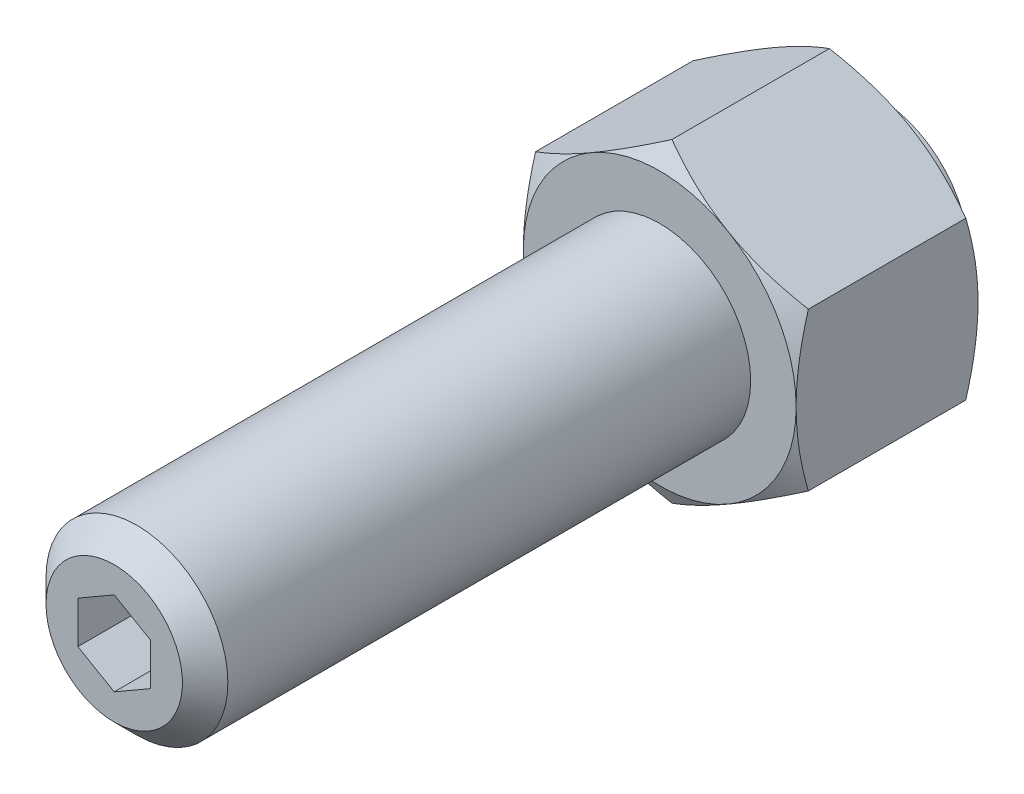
ISO-10303-21;
HEADER;
FILE_DESCRIPTION(('STEP AP214'),'2;1');
FILE_NAME('part.step','',(''),(''),'','','');
FILE_SCHEMA(('AUTOMOTIVE_DESIGN { 1 0 10303 214 1 1 1 1 }'));
ENDSEC;
DATA;
#1=APPLICATION_CONTEXT('core data for automotive mechanical design processes');
#2=APPLICATION_PROTOCOL_DEFINITION('international standard','automotive_design',2000,#1);
#3=PRODUCT_CONTEXT('',#1,'mechanical');
#4=PRODUCT('Part','Part','',(#3));
#5=PRODUCT_RELATED_PRODUCT_CATEGORY('part','',(#4));
#6=PRODUCT_DEFINITION_FORMATION('','',#4);
#7=PRODUCT_DEFINITION_CONTEXT('part definition',#1,'design');
#8=PRODUCT_DEFINITION('design','',#6,#7);
#9=PRODUCT_DEFINITION_SHAPE('','',#8);
#10=(LENGTH_UNIT() NAMED_UNIT(*) SI_UNIT(.MILLI.,.METRE.));
#11=(NAMED_UNIT(*) PLANE_ANGLE_UNIT() SI_UNIT($,.RADIAN.));
#12=(NAMED_UNIT(*) SI_UNIT($,.STERADIAN.) SOLID_ANGLE_UNIT());
#13=UNCERTAINTY_MEASURE_WITH_UNIT(LENGTH_MEASURE(1.E-05),#10,'distance_accuracy_value','');
#14=(GEOMETRIC_REPRESENTATION_CONTEXT(3) GLOBAL_UNCERTAINTY_ASSIGNED_CONTEXT((#13)) GLOBAL_UNIT_ASSIGNED_CONTEXT((#10,
#11,#12)) REPRESENTATION_CONTEXT('',''));
#15=CARTESIAN_POINT('',(0.,0.,0.));
#16=DIRECTION('',(0.,0.,1.));
#17=DIRECTION('',(1.,0.,0.));
#18=AXIS2_PLACEMENT_3D('',#15,#16,#17);
#19=CARTESIAN_POINT('',(0.,-17.3205080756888,144.));
#20=DIRECTION('',(-0.5,-0.866025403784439,0.));
#21=DIRECTION('',(-0.866025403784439,0.5,0.));
#22=AXIS2_PLACEMENT_3D('',#19,#20,#21);
#23=PLANE('',#22);
#24=DIRECTION('',(0.,0.,-1.));
#25=VECTOR('',#24,1.);
#26=CARTESIAN_POINT('',(-15.,-8.66025403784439,144.));
#27=LINE('',#26,#25);
#28=CARTESIAN_POINT('',(-15.,-8.66025403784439,22.6602540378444));
#29=VERTEX_POINT('',#28);
#30=CARTESIAN_POINT('',(-15.,-8.66025403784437,5.33974596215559));
#31=VERTEX_POINT('',#30);
#32=EDGE_CURVE('E170',#29,#31,#27,.T.);
#33=ORIENTED_EDGE('',*,*,#32,.T.);
#34=CARTESIAN_POINT('',(-15.0002,-8.66013856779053,5.33981262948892));
#35=CARTESIAN_POINT('',(-14.6705058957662,-8.85048754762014,5.2299217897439));
#36=CARTESIAN_POINT('',(-14.3395258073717,-9.04157899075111,5.12501758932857));
#37=CARTESIAN_POINT('',(-13.674911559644,-9.42529420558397,4.92656858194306));
#38=CARTESIAN_POINT('',(-13.3412765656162,-9.61791845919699,4.83302751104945));
#39=CARTESIAN_POINT('',(-12.6707077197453,-10.0050715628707,4.65856214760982));
#40=CARTESIAN_POINT('',(-12.333767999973,-10.199603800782,4.57766770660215));
#41=CARTESIAN_POINT('',(-11.6575472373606,-10.5900200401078,4.430232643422));
#42=CARTESIAN_POINT('',(-11.3182663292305,-10.7859039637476,4.36369120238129));
#43=CARTESIAN_POINT('',(-10.6460568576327,-11.1740042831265,4.24779237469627));
#44=CARTESIAN_POINT('',(-10.3131781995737,-11.3661918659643,4.19805138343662));
#45=CARTESIAN_POINT('',(-9.64589556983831,-11.7514476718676,4.11464674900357));
#46=CARTESIAN_POINT('',(-9.31149156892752,-11.9445159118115,4.08098341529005));
#47=CARTESIAN_POINT('',(-8.64212181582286,-12.3309767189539,4.03058407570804));
#48=CARTESIAN_POINT('',(-8.30715720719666,-12.5243686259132,4.01382795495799));
#49=CARTESIAN_POINT('',(-7.63691878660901,-12.9113309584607,3.99760339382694));
#50=CARTESIAN_POINT('',(-7.30164498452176,-13.104901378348,3.99813441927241));
#51=CARTESIAN_POINT('',(-6.6748531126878,-13.4667798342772,4.01527661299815));
#52=CARTESIAN_POINT('',(-6.38329037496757,-13.6351136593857,4.02979684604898));
#53=CARTESIAN_POINT('',(-5.80083556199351,-13.971394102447,4.07163714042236));
#54=CARTESIAN_POINT('',(-5.5099435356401,-14.1393406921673,4.09895810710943));
#55=CARTESIAN_POINT('',(-4.92898814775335,-14.4747554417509,4.16592351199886));
#56=CARTESIAN_POINT('',(-4.63892567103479,-14.6422230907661,4.20557812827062));
#57=CARTESIAN_POINT('',(-4.06016058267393,-14.9763732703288,4.29651510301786));
#58=CARTESIAN_POINT('',(-3.77145806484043,-15.1430557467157,4.34779825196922));
#59=CARTESIAN_POINT('',(-2.89508556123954,-15.6490296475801,4.52038686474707));
#60=CARTESIAN_POINT('',(-2.30995340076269,-15.9868558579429,4.65890117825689));
#61=CARTESIAN_POINT('',(-1.14841408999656,-16.6574708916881,4.97327196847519));
#62=CARTESIAN_POINT('',(-0.571992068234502,-16.9902683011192,5.14905461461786));
#63=CARTESIAN_POINT('',(0.0002000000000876,-17.3206235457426,5.33981262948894));
#64=B_SPLINE_CURVE_WITH_KNOTS('',3,(#34,#35,#36,#37,#38,#39,#40,#41,#42,#43,#44,#45,#46,#47,#48,
#49,#50,#51,#52,#53,#54,#55,#56,#57,#58,#59,#60,#61,#62,#63),.UNSPECIFIED.,.F.,.F.,(4,2,2,2,2,2,
2,2,2,2,2,2,2,2,4),(0.,1.18875411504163,2.37789802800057,3.56980778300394,4.76164951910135,
5.92407379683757,7.0865204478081,8.24758247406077,9.40860862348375,10.4193068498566,
11.4300765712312,12.4416826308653,13.4533574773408,15.5211962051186,17.5849760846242),.UNSPECIFIED.);
#65=CARTESIAN_POINT('',(-7.5,-12.9903810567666,4.));
#66=VERTEX_POINT('',#65);
#67=EDGE_CURVE('E149',#31,#66,#64,.T.);
#68=ORIENTED_EDGE('',*,*,#67,.T.);
#69=CARTESIAN_POINT('',(0.,-17.3205080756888,5.33974596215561));
#70=VERTEX_POINT('',#69);
#71=EDGE_CURVE('E160',#66,#70,#64,.T.);
#72=ORIENTED_EDGE('',*,*,#71,.T.);
#73=DIRECTION('',(0.,0.,-1.));
#74=VECTOR('',#73,1.);
#75=CARTESIAN_POINT('',(0.,-17.3205080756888,144.));
#76=LINE('',#75,#74);
#77=CARTESIAN_POINT('',(0.,-17.3205080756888,22.6602540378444));
#78=VERTEX_POINT('',#77);
#79=EDGE_CURVE('E349',#78,#70,#76,.T.);
#80=ORIENTED_EDGE('',*,*,#79,.F.);
#81=CARTESIAN_POINT('',(0.000200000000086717,-17.3206235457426,22.660187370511));
#82=CARTESIAN_POINT('',(-0.32949410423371,-17.130274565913,22.770078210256));
#83=CARTESIAN_POINT('',(-0.66047419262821,-16.9391831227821,22.8749824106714));
#84=CARTESIAN_POINT('',(-1.32508844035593,-16.5554679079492,23.0734314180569));
#85=CARTESIAN_POINT('',(-1.65872343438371,-16.3628436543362,23.1669724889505));
#86=CARTESIAN_POINT('',(-2.32929228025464,-15.9756905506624,23.3414378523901));
#87=CARTESIAN_POINT('',(-2.66623200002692,-15.7811583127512,23.4223322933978));
#88=CARTESIAN_POINT('',(-3.3424527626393,-15.3907420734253,23.5697673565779));
#89=CARTESIAN_POINT('',(-3.68173367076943,-15.1948581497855,23.6363087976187));
#90=CARTESIAN_POINT('',(-4.35394314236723,-14.8067578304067,23.7522076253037));
#91=CARTESIAN_POINT('',(-4.68682180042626,-14.6145702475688,23.8019486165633));
#92=CARTESIAN_POINT('',(-5.35410443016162,-14.2293144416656,23.8853532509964));
#93=CARTESIAN_POINT('',(-5.68850843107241,-14.0362462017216,23.9190165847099));
#94=CARTESIAN_POINT('',(-6.35787818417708,-13.6497853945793,23.9694159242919));
#95=CARTESIAN_POINT('',(-6.69284279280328,-13.4563934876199,23.986172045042));
#96=CARTESIAN_POINT('',(-7.36308121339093,-13.0694311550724,24.002396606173));
#97=CARTESIAN_POINT('',(-7.69835501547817,-12.8758607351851,24.0018655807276));
#98=CARTESIAN_POINT('',(-8.32514688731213,-12.5139822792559,23.9847233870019));
#99=CARTESIAN_POINT('',(-8.61670962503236,-12.3456484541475,23.970203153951));
#100=CARTESIAN_POINT('',(-9.19916443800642,-12.0093680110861,23.9283628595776));
#101=CARTESIAN_POINT('',(-9.49005646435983,-11.8414214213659,23.9010418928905));
#102=CARTESIAN_POINT('',(-10.0710118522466,-11.5060066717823,23.8340764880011));
#103=CARTESIAN_POINT('',(-10.3610743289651,-11.338539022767,23.7944218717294));
#104=CARTESIAN_POINT('',(-10.939839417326,-11.0043888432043,23.7034848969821));
#105=CARTESIAN_POINT('',(-11.2285419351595,-10.8377063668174,23.6522017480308));
#106=CARTESIAN_POINT('',(-12.1049144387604,-10.3317324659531,23.4796131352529));
#107=CARTESIAN_POINT('',(-12.6900465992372,-9.99390625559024,23.3410988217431));
#108=CARTESIAN_POINT('',(-13.8515859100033,-9.32329122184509,23.0267280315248));
#109=CARTESIAN_POINT('',(-14.4280079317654,-8.99049381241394,22.8509453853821));
#110=CARTESIAN_POINT('',(-15.0002,-8.66013856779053,22.6601873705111));
#111=B_SPLINE_CURVE_WITH_KNOTS('',3,(#81,#82,#83,#84,#85,#86,#87,#88,#89,#90,#91,#92,#93,#94,
#95,#96,#97,#98,#99,#100,#101,#102,#103,#104,#105,#106,#107,#108,#109,#110),.UNSPECIFIED.,.F.,
.F.,(4,2,2,2,2,2,2,2,2,2,2,2,2,2,4),(0.,1.18875411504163,2.37789802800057,3.56980778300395,
4.76164951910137,5.92407379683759,7.08652044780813,8.2475824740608,9.40860862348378,
10.4193068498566,11.4300765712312,12.4416826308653,13.4533574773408,15.5211962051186,
17.5849760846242),.UNSPECIFIED.);
#112=CARTESIAN_POINT('',(-7.5,-12.9903810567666,24.));
#113=VERTEX_POINT('',#112);
#114=EDGE_CURVE('E347',#78,#113,#111,.T.);
#115=ORIENTED_EDGE('',*,*,#114,.T.);
#116=EDGE_CURVE('E235',#113,#29,#111,.T.);
#117=ORIENTED_EDGE('',*,*,#116,.T.);
#118=EDGE_LOOP('',(#33,#68,#72,#80,#115,#117));
#119=FACE_BOUND('',#118,.T.);
#120=ADVANCED_FACE('F14',(#119),#23,.T.);
#121=CARTESIAN_POINT('',(-15.,-8.66025403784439,144.));
#122=DIRECTION('',(-1.,0.,0.));
#123=DIRECTION('',(0.,0.,-1.));
#124=AXIS2_PLACEMENT_3D('',#121,#122,#123);
#125=PLANE('',#124);
#126=DIRECTION('',(0.,0.,-1.));
#127=VECTOR('',#126,1.);
#128=CARTESIAN_POINT('',(-15.,8.66025403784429,144.));
#129=LINE('',#128,#127);
#130=CARTESIAN_POINT('',(-15.,8.66025403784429,22.6602540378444));
#131=VERTEX_POINT('',#130);
#132=CARTESIAN_POINT('',(-15.,8.66025403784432,5.33974596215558));
#133=VERTEX_POINT('',#132);
#134=EDGE_CURVE('E306',#131,#133,#129,.T.);
#135=ORIENTED_EDGE('',*,*,#134,.T.);
#136=CARTESIAN_POINT('',(-15.,-23.2298513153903,11.3045613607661));
#137=CARTESIAN_POINT('',(-15.,-22.9024315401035,11.145758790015));
#138=CARTESIAN_POINT('',(-15.,-22.5746266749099,10.9877505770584));
#139=CARTESIAN_POINT('',(-15.,-21.918166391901,10.673502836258));
#140=CARTESIAN_POINT('',(-15.,-21.58951096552,10.5172633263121));
#141=CARTESIAN_POINT('',(-15.,-20.6020603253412,10.0514264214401));
#142=CARTESIAN_POINT('',(-15.,-19.9418780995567,9.74475799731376));
#143=CARTESIAN_POINT('',(-15.,-18.6134763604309,9.13943419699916));
#144=CARTESIAN_POINT('',(-15.,-17.9452326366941,8.84083182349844));
#145=CARTESIAN_POINT('',(-15.,-16.6034196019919,8.25588536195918));
#146=CARTESIAN_POINT('',(-15.,-15.9298505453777,7.96954069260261));
#147=CARTESIAN_POINT('',(-15.,-14.5546741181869,7.40344566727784));
#148=CARTESIAN_POINT('',(-15.,-13.8528585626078,7.12419839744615));
#149=CARTESIAN_POINT('',(-15.,-12.4409995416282,6.58691652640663));
#150=CARTESIAN_POINT('',(-15.,-11.7309551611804,6.3288843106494));
#151=CARTESIAN_POINT('',(-15.,-10.3028718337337,5.8408343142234));
#152=CARTESIAN_POINT('',(-15.,-9.58485252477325,5.61075953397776));
#153=CARTESIAN_POINT('',(-15.,-8.13844602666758,5.18601609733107));
#154=CARTESIAN_POINT('',(-15.,-7.41006219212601,4.99133625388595));
#155=CARTESIAN_POINT('',(-15.,-6.31160782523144,4.73345679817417));
#156=CARTESIAN_POINT('',(-15.,-5.94548011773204,4.65335892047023));
#157=CARTESIAN_POINT('',(-15.,-5.21072911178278,4.50549991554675));
#158=CARTESIAN_POINT('',(-15.,-4.84210586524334,4.43773853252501));
#159=CARTESIAN_POINT('',(-15.,-4.10261909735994,4.3157504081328));
#160=CARTESIAN_POINT('',(-15.,-3.73175559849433,4.26152353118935));
#161=CARTESIAN_POINT('',(-15.,-2.98818690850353,4.16768789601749));
#162=CARTESIAN_POINT('',(-15.,-2.61548179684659,4.12807851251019));
#163=CARTESIAN_POINT('',(-15.,-1.87359955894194,4.06475906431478));
#164=CARTESIAN_POINT('',(-15.,-1.50443962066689,4.04084884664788));
#165=CARTESIAN_POINT('',(-15.,-0.76544030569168,4.0086589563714));
#166=CARTESIAN_POINT('',(-15.,-0.395600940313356,4.0003790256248));
#167=CARTESIAN_POINT('',(-15.,0.344097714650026,3.99964649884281));
#168=CARTESIAN_POINT('',(-15.,0.713957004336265,4.00719399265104));
#169=CARTESIAN_POINT('',(-15.,1.45302877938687,4.03793284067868));
#170=CARTESIAN_POINT('',(-15.,1.82224123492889,4.06112489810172));
#171=CARTESIAN_POINT('',(-15.,2.71058127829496,4.13525663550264));
#172=CARTESIAN_POINT('',(-15.,3.22909566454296,4.19367504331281));
#173=CARTESIAN_POINT('',(-15.,4.2622575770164,4.33817782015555));
#174=CARTESIAN_POINT('',(-15.,4.77690456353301,4.42426597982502));
#175=CARTESIAN_POINT('',(-15.,5.80184804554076,4.62104570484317));
#176=CARTESIAN_POINT('',(-15.,6.31214079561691,4.73175659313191));
#177=CARTESIAN_POINT('',(-15.,7.32759813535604,4.97440501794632));
#178=CARTESIAN_POINT('',(-15.,7.83276280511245,5.10634222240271));
#179=CARTESIAN_POINT('',(-15.,8.84901878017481,5.3913378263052));
#180=CARTESIAN_POINT('',(-15.,9.35999724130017,5.54479583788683));
#181=CARTESIAN_POINT('',(-15.,10.3769202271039,5.86748743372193));
#182=CARTESIAN_POINT('',(-15.,10.88286471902,6.03672112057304));
#183=CARTESIAN_POINT('',(-15.,11.8899708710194,6.38828406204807));
#184=CARTESIAN_POINT('',(-15.,12.3911340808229,6.57060889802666));
#185=CARTESIAN_POINT('',(-15.,13.3893134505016,6.9462170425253));
#186=CARTESIAN_POINT('',(-15.,13.8863296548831,7.13950023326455));
#187=CARTESIAN_POINT('',(-15.,15.0422734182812,7.60136907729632));
#188=CARTESIAN_POINT('',(-15.,15.6997724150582,7.87352429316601));
#189=CARTESIAN_POINT('',(-15.,17.0093040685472,8.43071923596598));
#190=CARTESIAN_POINT('',(-15.,17.6613364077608,8.71575970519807));
#191=CARTESIAN_POINT('',(-15.,18.960929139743,9.29619359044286));
#192=CARTESIAN_POINT('',(-15.,19.6084885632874,9.59158917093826));
#193=CARTESIAN_POINT('',(-15.,20.8997296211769,10.1906846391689));
#194=CARTESIAN_POINT('',(-15.,21.5434113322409,10.4943843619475));
#195=CARTESIAN_POINT('',(-15.,22.8281997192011,11.1088841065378));
#196=CARTESIAN_POINT('',(-15.,23.4693029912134,11.4196912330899));
#197=CARTESIAN_POINT('',(-15.,24.7487652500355,12.0469023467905));
#198=CARTESIAN_POINT('',(-15.,25.387124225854,12.3633063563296));
#199=CARTESIAN_POINT('',(-15.,26.6614350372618,13.0007283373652));
#200=CARTESIAN_POINT('',(-15.,27.297387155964,13.3217457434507));
#201=CARTESIAN_POINT('',(-15.,28.5673043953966,13.967689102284));
#202=CARTESIAN_POINT('',(-15.,29.2012695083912,14.292615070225));
#203=CARTESIAN_POINT('',(-15.,30.9971111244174,15.2189409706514));
#204=CARTESIAN_POINT('',(-15.,32.1569729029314,15.8242468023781));
#205=CARTESIAN_POINT('',(-15.,34.4723515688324,17.043185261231));
#206=CARTESIAN_POINT('',(-15.,35.6278683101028,17.6568181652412));
#207=CARTESIAN_POINT('',(-15.,37.9327101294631,18.8889965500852));
#208=CARTESIAN_POINT('',(-15.,39.0820434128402,19.5075266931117));
#209=CARTESIAN_POINT('',(-15.,40.8039849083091,20.4390499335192));
#210=CARTESIAN_POINT('',(-15.,41.3776074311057,20.7501708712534));
#211=CARTESIAN_POINT('',(-15.,42.5242429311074,21.3735319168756));
#212=CARTESIAN_POINT('',(-15.,43.097255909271,21.6857720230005));
#213=CARTESIAN_POINT('',(-15.,43.6699983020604,21.998507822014));
#214=B_SPLINE_CURVE_WITH_KNOTS('',3,(#136,#137,#138,#139,#140,#141,#142,#143,#144,#145,#146,
#147,#148,#149,#150,#151,#152,#153,#154,#155,#156,#157,#158,#159,#160,#161,#162,#163,#164,#165,
#166,#167,#168,#169,#170,#171,#172,#173,#174,#175,#176,#177,#178,#179,#180,#181,#182,#183,#184,
#185,#186,#187,#188,#189,#190,#191,#192,#193,#194,#195,#196,#197,#198,#199,#200,#201,#202,#203,
#204,#205,#206,#207,#208,#209,#210,#211,#212,#213),.UNSPECIFIED.,.F.,.F.,(4,2,2,2,2,2,2,2,2,2,2,
2,2,2,2,2,2,2,2,2,2,2,2,2,2,2,2,2,2,2,2,2,2,2,2,2,2,2,4),(0.,1.09169288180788,2.18339680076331,
4.36712937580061,6.56280610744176,8.75837859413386,11.0241081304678,13.2900920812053,
15.5513757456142,17.8119434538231,18.9361297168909,20.0602926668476,21.1844443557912,
22.3085479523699,23.4180264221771,24.5274865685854,25.6369530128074,26.746469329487,
28.3109874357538,29.8757199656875,31.4416847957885,33.007625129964,34.6078938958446,
36.2081730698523,37.8079146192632,39.4076389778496,41.5422520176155,43.6769881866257,
45.81217326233,47.947315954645,50.0846953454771,52.2220832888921,54.3592114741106,
56.4963479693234,60.4212262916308,64.3462354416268,68.2618180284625,70.2195074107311,
72.1771937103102),.UNSPECIFIED.);
#215=CARTESIAN_POINT('',(-15.,0.,4.));
#216=VERTEX_POINT('',#215);
#217=EDGE_CURVE('E289',#133,#216,#214,.F.);
#218=ORIENTED_EDGE('',*,*,#217,.T.);
#219=EDGE_CURVE('E151',#216,#31,#214,.F.);
#220=ORIENTED_EDGE('',*,*,#219,.T.);
#221=ORIENTED_EDGE('',*,*,#32,.F.);
#222=CARTESIAN_POINT('',(-15.,-23.2298513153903,16.6954386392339));
#223=CARTESIAN_POINT('',(-15.,-22.9024315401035,16.854241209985));
#224=CARTESIAN_POINT('',(-15.,-22.5746266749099,17.0122494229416));
#225=CARTESIAN_POINT('',(-15.,-21.918166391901,17.326497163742));
#226=CARTESIAN_POINT('',(-15.,-21.58951096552,17.4827366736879));
#227=CARTESIAN_POINT('',(-15.,-20.6020603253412,17.9485735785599));
#228=CARTESIAN_POINT('',(-15.,-19.9418780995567,18.2552420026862));
#229=CARTESIAN_POINT('',(-15.,-18.6134763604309,18.8605658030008));
#230=CARTESIAN_POINT('',(-15.,-17.9452326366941,19.1591681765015));
#231=CARTESIAN_POINT('',(-15.,-16.6034196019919,19.7441146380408));
#232=CARTESIAN_POINT('',(-15.,-15.9298505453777,20.0304593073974));
#233=CARTESIAN_POINT('',(-15.,-14.5546741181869,20.5965543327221));
#234=CARTESIAN_POINT('',(-15.,-13.8528585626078,20.8758016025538));
#235=CARTESIAN_POINT('',(-15.,-12.4409995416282,21.4130834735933));
#236=CARTESIAN_POINT('',(-15.,-11.7309551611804,21.6711156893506));
#237=CARTESIAN_POINT('',(-15.,-10.3028718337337,22.1591656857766));
#238=CARTESIAN_POINT('',(-15.,-9.58485252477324,22.3892404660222));
#239=CARTESIAN_POINT('',(-15.,-8.13844602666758,22.8139839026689));
#240=CARTESIAN_POINT('',(-15.,-7.41006219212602,23.0086637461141));
#241=CARTESIAN_POINT('',(-15.,-6.31160782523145,23.2665432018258));
#242=CARTESIAN_POINT('',(-15.,-5.94548011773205,23.3466410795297));
#243=CARTESIAN_POINT('',(-15.,-5.21072911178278,23.4945000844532));
#244=CARTESIAN_POINT('',(-15.,-4.84210586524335,23.562261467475));
#245=CARTESIAN_POINT('',(-15.,-4.10261909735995,23.6842495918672));
#246=CARTESIAN_POINT('',(-15.,-3.73175559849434,23.7384764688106));
#247=CARTESIAN_POINT('',(-15.,-2.98818690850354,23.8323121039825));
#248=CARTESIAN_POINT('',(-15.,-2.61548179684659,23.8719214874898));
#249=CARTESIAN_POINT('',(-15.,-1.87359955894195,23.9352409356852));
#250=CARTESIAN_POINT('',(-15.,-1.5044396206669,23.9591511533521));
#251=CARTESIAN_POINT('',(-15.,-0.765440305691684,23.9913410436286));
#252=CARTESIAN_POINT('',(-15.,-0.395600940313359,23.9996209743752));
#253=CARTESIAN_POINT('',(-15.,0.344097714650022,24.0003535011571));
#254=CARTESIAN_POINT('',(-15.,0.713957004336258,23.9928060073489));
#255=CARTESIAN_POINT('',(-15.,1.45302877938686,23.9620671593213));
#256=CARTESIAN_POINT('',(-15.,1.82224123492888,23.9388751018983));
#257=CARTESIAN_POINT('',(-15.,2.71058127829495,23.8647433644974));
#258=CARTESIAN_POINT('',(-15.,3.22909566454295,23.8063249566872));
#259=CARTESIAN_POINT('',(-15.,4.26225757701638,23.6618221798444));
#260=CARTESIAN_POINT('',(-15.,4.77690456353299,23.5757340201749));
#261=CARTESIAN_POINT('',(-15.,5.80184804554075,23.3789542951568));
#262=CARTESIAN_POINT('',(-15.,6.3121407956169,23.2682434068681));
#263=CARTESIAN_POINT('',(-15.,7.32759813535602,23.0255949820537));
#264=CARTESIAN_POINT('',(-15.,7.83276280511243,22.8936577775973));
#265=CARTESIAN_POINT('',(-15.,8.84901878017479,22.6086621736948));
#266=CARTESIAN_POINT('',(-15.,9.35999724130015,22.4552041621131));
#267=CARTESIAN_POINT('',(-15.,10.3769202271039,22.132512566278));
#268=CARTESIAN_POINT('',(-15.,10.88286471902,21.9632788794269));
#269=CARTESIAN_POINT('',(-15.,11.8899708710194,21.6117159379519));
#270=CARTESIAN_POINT('',(-15.,12.3911340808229,21.4293911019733));
#271=CARTESIAN_POINT('',(-15.,13.3893134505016,21.0537829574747));
#272=CARTESIAN_POINT('',(-15.,13.8863296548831,20.8604997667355));
#273=CARTESIAN_POINT('',(-15.,15.0422734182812,20.3986309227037));
#274=CARTESIAN_POINT('',(-15.,15.6997724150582,20.126475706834));
#275=CARTESIAN_POINT('',(-15.,17.0093040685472,19.569280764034));
#276=CARTESIAN_POINT('',(-15.,17.6613364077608,19.2842402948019));
#277=CARTESIAN_POINT('',(-15.,18.960929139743,18.7038064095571));
#278=CARTESIAN_POINT('',(-15.,19.6084885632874,18.4084108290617));
#279=CARTESIAN_POINT('',(-15.,20.8997296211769,17.809315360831));
#280=CARTESIAN_POINT('',(-15.,21.5434113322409,17.5056156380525));
#281=CARTESIAN_POINT('',(-15.,22.8281997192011,16.8911158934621));
#282=CARTESIAN_POINT('',(-15.,23.4693029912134,16.5803087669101));
#283=CARTESIAN_POINT('',(-15.,24.7487652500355,15.9530976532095));
#284=CARTESIAN_POINT('',(-15.,25.387124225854,15.6366936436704));
#285=CARTESIAN_POINT('',(-15.,26.6614350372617,14.9992716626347));
#286=CARTESIAN_POINT('',(-15.,27.297387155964,14.6782542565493));
#287=CARTESIAN_POINT('',(-15.,28.5673043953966,14.0323108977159));
#288=CARTESIAN_POINT('',(-15.,29.2012695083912,13.707384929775));
#289=CARTESIAN_POINT('',(-15.,30.9971111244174,12.7810590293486));
#290=CARTESIAN_POINT('',(-15.,32.1569729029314,12.1757531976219));
#291=CARTESIAN_POINT('',(-15.,34.4723515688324,10.9568147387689));
#292=CARTESIAN_POINT('',(-15.,35.6278683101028,10.3431818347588));
#293=CARTESIAN_POINT('',(-15.,37.9327101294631,9.11100344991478));
#294=CARTESIAN_POINT('',(-15.,39.0820434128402,8.49247330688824));
#295=CARTESIAN_POINT('',(-15.,40.8039849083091,7.56095006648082));
#296=CARTESIAN_POINT('',(-15.,41.3776074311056,7.24982912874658));
#297=CARTESIAN_POINT('',(-15.,42.5242429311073,6.62646808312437));
#298=CARTESIAN_POINT('',(-15.,43.0972559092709,6.31422797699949));
#299=CARTESIAN_POINT('',(-15.,43.6699983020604,6.00149217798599));
#300=B_SPLINE_CURVE_WITH_KNOTS('',3,(#222,#223,#224,#225,#226,#227,#228,#229,#230,#231,#232,
#233,#234,#235,#236,#237,#238,#239,#240,#241,#242,#243,#244,#245,#246,#247,#248,#249,#250,#251,
#252,#253,#254,#255,#256,#257,#258,#259,#260,#261,#262,#263,#264,#265,#266,#267,#268,#269,#270,
#271,#272,#273,#274,#275,#276,#277,#278,#279,#280,#281,#282,#283,#284,#285,#286,#287,#288,#289,
#290,#291,#292,#293,#294,#295,#296,#297,#298,#299),.UNSPECIFIED.,.F.,.F.,(4,2,2,2,2,2,2,2,2,2,2,
2,2,2,2,2,2,2,2,2,2,2,2,2,2,2,2,2,2,2,2,2,2,2,2,2,2,2,4),(0.,1.09169288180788,2.1833968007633,
4.3671293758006,6.56280610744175,8.75837859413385,11.0241081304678,13.2900920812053,
15.5513757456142,17.8119434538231,18.9361297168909,20.0602926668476,21.1844443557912,
22.3085479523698,23.4180264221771,24.5274865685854,25.6369530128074,26.746469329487,
28.3109874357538,29.8757199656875,31.4416847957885,33.0076251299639,34.6078938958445,
36.2081730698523,37.8079146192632,39.4076389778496,41.5422520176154,43.6769881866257,
45.8121732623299,47.947315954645,50.0846953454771,52.2220832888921,54.3592114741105,
56.4963479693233,60.4212262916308,64.3462354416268,68.2618180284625,70.219507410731,
72.1771937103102),.UNSPECIFIED.);
#301=CARTESIAN_POINT('',(-15.,0.,24.));
#302=VERTEX_POINT('',#301);
#303=EDGE_CURVE('E245',#29,#302,#300,.T.);
#304=ORIENTED_EDGE('',*,*,#303,.T.);
#305=EDGE_CURVE('E265',#302,#131,#300,.T.);
#306=ORIENTED_EDGE('',*,*,#305,.T.);
#307=EDGE_LOOP('',(#135,#218,#220,#221,#304,#306));
#308=FACE_BOUND('',#307,.T.);
#309=ADVANCED_FACE('F269',(#308),#125,.T.);
#310=CARTESIAN_POINT('',(0.,17.3205080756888,144.));
#311=DIRECTION('',(0.500000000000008,-0.866025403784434,0.));
#312=DIRECTION('',(-0.866025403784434,-0.500000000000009,0.));
#313=AXIS2_PLACEMENT_3D('',#310,#311,#312);
#314=PLANE('',#313);
#315=CARTESIAN_POINT('',(-15.0002,8.66013856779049,5.33981262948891));
#316=CARTESIAN_POINT('',(-14.6705058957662,8.85048754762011,5.2299217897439));
#317=CARTESIAN_POINT('',(-14.3395258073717,9.04157899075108,5.12501758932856));
#318=CARTESIAN_POINT('',(-13.674911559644,9.42529420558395,4.92656858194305));
#319=CARTESIAN_POINT('',(-13.3412765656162,9.61791845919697,4.83302751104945));
#320=CARTESIAN_POINT('',(-12.6707077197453,10.0050715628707,4.65856214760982));
#321=CARTESIAN_POINT('',(-12.333767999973,10.1996038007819,4.57766770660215));
#322=CARTESIAN_POINT('',(-11.6575472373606,10.5900200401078,4.43023264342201));
#323=CARTESIAN_POINT('',(-11.3182663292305,10.7859039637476,4.36369120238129));
#324=CARTESIAN_POINT('',(-10.6460568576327,11.1740042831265,4.24779237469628));
#325=CARTESIAN_POINT('',(-10.3131781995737,11.3661918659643,4.19805138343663));
#326=CARTESIAN_POINT('',(-9.64589556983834,11.7514476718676,4.11464674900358));
#327=CARTESIAN_POINT('',(-9.31149156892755,11.9445159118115,4.08098341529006));
#328=CARTESIAN_POINT('',(-8.64212181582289,12.3309767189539,4.03058407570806));
#329=CARTESIAN_POINT('',(-8.30715720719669,12.5243686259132,4.01382795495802));
#330=CARTESIAN_POINT('',(-7.63691878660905,12.9113309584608,3.99760339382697));
#331=CARTESIAN_POINT('',(-7.30164498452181,13.1049013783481,3.99813441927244));
#332=CARTESIAN_POINT('',(-6.67485311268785,13.4667798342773,4.01527661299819));
#333=CARTESIAN_POINT('',(-6.38329037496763,13.6351136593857,4.02979684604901));
#334=CARTESIAN_POINT('',(-5.80083556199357,13.9713941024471,4.07163714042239));
#335=CARTESIAN_POINT('',(-5.50994353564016,14.1393406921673,4.09895810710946));
#336=CARTESIAN_POINT('',(-4.92898814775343,14.4747554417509,4.1659235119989));
#337=CARTESIAN_POINT('',(-4.63892567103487,14.6422230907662,4.20557812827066));
#338=CARTESIAN_POINT('',(-4.06016058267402,14.9763732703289,4.2965151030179));
#339=CARTESIAN_POINT('',(-3.77145806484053,15.1430557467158,4.34779825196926));
#340=CARTESIAN_POINT('',(-2.89508556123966,15.6490296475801,4.52038686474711));
#341=CARTESIAN_POINT('',(-2.30995340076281,15.986855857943,4.65890117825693));
#342=CARTESIAN_POINT('',(-1.14841408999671,16.6574708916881,4.97327196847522));
#343=CARTESIAN_POINT('',(-0.571992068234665,16.9902683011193,5.14905461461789));
#344=CARTESIAN_POINT('',(0.000199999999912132,17.3206235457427,5.33981262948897));
#345=B_SPLINE_CURVE_WITH_KNOTS('',3,(#315,#316,#317,#318,#319,#320,#321,#322,#323,#324,#325,
#326,#327,#328,#329,#330,#331,#332,#333,#334,#335,#336,#337,#338,#339,#340,#341,#342,#343,#344),
.UNSPECIFIED.,.F.,.F.,(4,2,2,2,2,2,2,2,2,2,2,2,2,2,4),(0.,1.18875411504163,2.37789802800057,
3.56980778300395,4.76164951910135,5.92407379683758,7.0865204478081,8.24758247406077,
9.40860862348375,10.4193068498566,11.4300765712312,12.4416826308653,13.4533574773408,
15.5211962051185,17.5849760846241),.UNSPECIFIED.);
#346=CARTESIAN_POINT('',(-7.50000000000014,12.9903810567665,4.));
#347=VERTEX_POINT('',#346);
#348=EDGE_CURVE('E280',#133,#347,#345,.T.);
#349=ORIENTED_EDGE('',*,*,#348,.F.);
#350=ORIENTED_EDGE('',*,*,#134,.F.);
#351=CARTESIAN_POINT('',(0.000199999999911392,17.3206235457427,22.660187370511));
#352=CARTESIAN_POINT('',(-0.329494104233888,17.1302745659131,22.770078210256));
#353=CARTESIAN_POINT('',(-0.660474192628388,16.9391831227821,22.8749824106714));
#354=CARTESIAN_POINT('',(-1.3250884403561,16.5554679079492,23.0734314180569));
#355=CARTESIAN_POINT('',(-1.65872343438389,16.3628436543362,23.1669724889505));
#356=CARTESIAN_POINT('',(-2.32929228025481,15.9756905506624,23.3414378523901));
#357=CARTESIAN_POINT('',(-2.66623200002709,15.7811583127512,23.4223322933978));
#358=CARTESIAN_POINT('',(-3.34245276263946,15.3907420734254,23.5697673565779));
#359=CARTESIAN_POINT('',(-3.68173367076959,15.1948581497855,23.6363087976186));
#360=CARTESIAN_POINT('',(-4.35394314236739,14.8067578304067,23.7522076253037));
#361=CARTESIAN_POINT('',(-4.68682180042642,14.6145702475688,23.8019486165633));
#362=CARTESIAN_POINT('',(-5.35410443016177,14.2293144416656,23.8853532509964));
#363=CARTESIAN_POINT('',(-5.68850843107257,14.0362462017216,23.9190165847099));
#364=CARTESIAN_POINT('',(-6.35787818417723,13.6497853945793,23.9694159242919));
#365=CARTESIAN_POINT('',(-6.69284279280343,13.4563934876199,23.9861720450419));
#366=CARTESIAN_POINT('',(-7.36308121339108,13.0694311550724,24.002396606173));
#367=CARTESIAN_POINT('',(-7.69835501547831,12.8758607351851,24.0018655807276));
#368=CARTESIAN_POINT('',(-8.32514688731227,12.5139822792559,23.9847233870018));
#369=CARTESIAN_POINT('',(-8.6167096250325,12.3456484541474,23.970203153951));
#370=CARTESIAN_POINT('',(-9.19916443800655,12.0093680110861,23.9283628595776));
#371=CARTESIAN_POINT('',(-9.49005646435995,11.8414214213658,23.9010418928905));
#372=CARTESIAN_POINT('',(-10.0710118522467,11.5060066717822,23.8340764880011));
#373=CARTESIAN_POINT('',(-10.3610743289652,11.338539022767,23.7944218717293));
#374=CARTESIAN_POINT('',(-10.9398394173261,11.0043888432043,23.7034848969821));
#375=CARTESIAN_POINT('',(-11.2285419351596,10.8377063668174,23.6522017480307));
#376=CARTESIAN_POINT('',(-12.1049144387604,10.331732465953,23.4796131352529));
#377=CARTESIAN_POINT('',(-12.6900465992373,9.99390625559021,23.3410988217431));
#378=CARTESIAN_POINT('',(-13.8515859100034,9.32329122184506,23.0267280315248));
#379=CARTESIAN_POINT('',(-14.4280079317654,8.9904938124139,22.8509453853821));
#380=CARTESIAN_POINT('',(-15.0002,8.66013856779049,22.6601873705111));
#381=B_SPLINE_CURVE_WITH_KNOTS('',3,(#351,#352,#353,#354,#355,#356,#357,#358,#359,#360,#361,
#362,#363,#364,#365,#366,#367,#368,#369,#370,#371,#372,#373,#374,#375,#376,#377,#378,#379,#380),
.UNSPECIFIED.,.F.,.F.,(4,2,2,2,2,2,2,2,2,2,2,2,2,2,4),(0.,1.18875411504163,2.37789802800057,
3.56980778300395,4.76164951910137,5.9240737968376,7.08652044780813,8.24758247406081,
9.4086086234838,10.4193068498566,11.4300765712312,12.4416826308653,13.4533574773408,
15.5211962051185,17.584976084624),.UNSPECIFIED.);
#382=CARTESIAN_POINT('',(-7.50000000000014,12.9903810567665,24.));
#383=VERTEX_POINT('',#382);
#384=EDGE_CURVE('E259',#383,#131,#381,.T.);
#385=ORIENTED_EDGE('',*,*,#384,.F.);
#386=CARTESIAN_POINT('',(0.,17.3205080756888,22.6602540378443));
#387=VERTEX_POINT('',#386);
#388=EDGE_CURVE('E264',#387,#383,#381,.T.);
#389=ORIENTED_EDGE('',*,*,#388,.F.);
#390=DIRECTION('',(0.,0.,-1.));
#391=VECTOR('',#390,1.);
#392=CARTESIAN_POINT('',(0.,17.3205080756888,144.));
#393=LINE('',#392,#391);
#394=CARTESIAN_POINT('',(0.,17.3205080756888,5.33974596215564));
#395=VERTEX_POINT('',#394);
#396=EDGE_CURVE('E314',#387,#395,#393,.T.);
#397=ORIENTED_EDGE('',*,*,#396,.T.);
#398=EDGE_CURVE('E274',#347,#395,#345,.T.);
#399=ORIENTED_EDGE('',*,*,#398,.F.);
#400=EDGE_LOOP('',(#349,#350,#385,#389,#397,#399));
#401=FACE_BOUND('',#400,.T.);
#402=ADVANCED_FACE('F266',(#401),#314,.F.);
#403=CARTESIAN_POINT('',(0.,17.3205080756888,144.));
#404=DIRECTION('',(0.5,0.866025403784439,0.));
#405=DIRECTION('',(0.866025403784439,-0.5,0.));
#406=AXIS2_PLACEMENT_3D('',#403,#404,#405);
#407=PLANE('',#406);
#408=DIRECTION('',(0.,0.,-1.));
#409=VECTOR('',#408,1.);
#410=CARTESIAN_POINT('',(15.,8.6602540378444,144.));
#411=LINE('',#410,#409);
#412=CARTESIAN_POINT('',(15.,8.66025403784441,22.6602540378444));
#413=VERTEX_POINT('',#412);
#414=CARTESIAN_POINT('',(15.,8.6602540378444,5.3397459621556));
#415=VERTEX_POINT('',#414);
#416=EDGE_CURVE('E326',#413,#415,#411,.T.);
#417=ORIENTED_EDGE('',*,*,#416,.T.);
#418=CARTESIAN_POINT('',(15.0002,8.66013856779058,5.33981262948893));
#419=CARTESIAN_POINT('',(14.6705058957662,8.85048754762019,5.22992178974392));
#420=CARTESIAN_POINT('',(14.3395258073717,9.04157899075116,5.12501758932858));
#421=CARTESIAN_POINT('',(13.674911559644,9.42529420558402,4.92656858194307));
#422=CARTESIAN_POINT('',(13.3412765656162,9.61791845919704,4.83302751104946));
#423=CARTESIAN_POINT('',(12.6707077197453,10.0050715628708,4.65856214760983));
#424=CARTESIAN_POINT('',(12.333767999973,10.199603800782,4.57766770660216));
#425=CARTESIAN_POINT('',(11.6575472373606,10.5900200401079,4.43023264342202));
#426=CARTESIAN_POINT('',(11.3182663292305,10.7859039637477,4.3636912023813));
#427=CARTESIAN_POINT('',(10.6460568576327,11.1740042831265,4.24779237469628));
#428=CARTESIAN_POINT('',(10.3131781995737,11.3661918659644,4.19805138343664));
#429=CARTESIAN_POINT('',(9.64589556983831,11.7514476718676,4.11464674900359));
#430=CARTESIAN_POINT('',(9.31149156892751,11.9445159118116,4.08098341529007));
#431=CARTESIAN_POINT('',(8.64212181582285,12.3309767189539,4.03058407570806));
#432=CARTESIAN_POINT('',(8.30715720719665,12.5243686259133,4.01382795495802));
#433=CARTESIAN_POINT('',(7.63691878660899,12.9113309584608,3.99760339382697));
#434=CARTESIAN_POINT('',(7.30164498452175,13.1049013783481,3.99813441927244));
#435=CARTESIAN_POINT('',(6.67485311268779,13.4667798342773,4.01527661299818));
#436=CARTESIAN_POINT('',(6.38329037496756,13.6351136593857,4.029796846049));
#437=CARTESIAN_POINT('',(5.8008355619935,13.9713941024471,4.07163714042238));
#438=CARTESIAN_POINT('',(5.50994353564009,14.1393406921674,4.09895810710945));
#439=CARTESIAN_POINT('',(4.92898814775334,14.4747554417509,4.16592351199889));
#440=CARTESIAN_POINT('',(4.63892567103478,14.6422230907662,4.20557812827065));
#441=CARTESIAN_POINT('',(4.06016058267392,14.9763732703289,4.29651510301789));
#442=CARTESIAN_POINT('',(3.77145806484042,15.1430557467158,4.34779825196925));
#443=CARTESIAN_POINT('',(2.89508556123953,15.6490296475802,4.5203868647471));
#444=CARTESIAN_POINT('',(2.30995340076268,15.986855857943,4.65890117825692));
#445=CARTESIAN_POINT('',(1.14841408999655,16.6574708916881,4.97327196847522));
#446=CARTESIAN_POINT('',(0.571992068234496,16.9902683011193,5.14905461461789));
#447=CARTESIAN_POINT('',(-0.000200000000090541,17.3206235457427,5.33981262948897));
#448=B_SPLINE_CURVE_WITH_KNOTS('',3,(#418,#419,#420,#421,#422,#423,#424,#425,#426,#427,#428,
#429,#430,#431,#432,#433,#434,#435,#436,#437,#438,#439,#440,#441,#442,#443,#444,#445,#446,#447),
.UNSPECIFIED.,.F.,.F.,(4,2,2,2,2,2,2,2,2,2,2,2,2,2,4),(0.,1.18875411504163,2.37789802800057,
3.56980778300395,4.76164951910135,5.92407379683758,7.08652044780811,8.24758247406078,
9.40860862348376,10.4193068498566,11.4300765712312,12.4416826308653,13.4533574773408,
15.5211962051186,17.5849760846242),.UNSPECIFIED.);
#449=CARTESIAN_POINT('',(7.5,12.9903810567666,4.));
#450=VERTEX_POINT('',#449);
#451=EDGE_CURVE('E165',#415,#450,#448,.T.);
#452=ORIENTED_EDGE('',*,*,#451,.T.);
#453=EDGE_CURVE('E171',#450,#395,#448,.T.);
#454=ORIENTED_EDGE('',*,*,#453,.T.);
#455=ORIENTED_EDGE('',*,*,#396,.F.);
#456=CARTESIAN_POINT('',(-0.000200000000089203,17.3206235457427,22.660187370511));
#457=CARTESIAN_POINT('',(0.32949410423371,17.1302745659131,22.770078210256));
#458=CARTESIAN_POINT('',(0.660474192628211,16.9391831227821,22.8749824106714));
#459=CARTESIAN_POINT('',(1.32508844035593,16.5554679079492,23.0734314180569));
#460=CARTESIAN_POINT('',(1.65872343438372,16.3628436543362,23.1669724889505));
#461=CARTESIAN_POINT('',(2.32929228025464,15.9756905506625,23.3414378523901));
#462=CARTESIAN_POINT('',(2.66623200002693,15.7811583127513,23.4223322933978));
#463=CARTESIAN_POINT('',(3.3424527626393,15.3907420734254,23.5697673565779));
#464=CARTESIAN_POINT('',(3.68173367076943,15.1948581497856,23.6363087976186));
#465=CARTESIAN_POINT('',(4.35394314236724,14.8067578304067,23.7522076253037));
#466=CARTESIAN_POINT('',(4.68682180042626,14.6145702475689,23.8019486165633));
#467=CARTESIAN_POINT('',(5.35410443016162,14.2293144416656,23.8853532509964));
#468=CARTESIAN_POINT('',(5.68850843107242,14.0362462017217,23.9190165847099));
#469=CARTESIAN_POINT('',(6.35787818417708,13.6497853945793,23.9694159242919));
#470=CARTESIAN_POINT('',(6.69284279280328,13.45639348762,23.9861720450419));
#471=CARTESIAN_POINT('',(7.36308121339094,13.0694311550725,24.002396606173));
#472=CARTESIAN_POINT('',(7.69835501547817,12.8758607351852,24.0018655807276));
#473=CARTESIAN_POINT('',(8.32514688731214,12.513982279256,23.9847233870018));
#474=CARTESIAN_POINT('',(8.61670962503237,12.3456484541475,23.970203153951));
#475=CARTESIAN_POINT('',(9.19916443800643,12.0093680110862,23.9283628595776));
#476=CARTESIAN_POINT('',(9.49005646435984,11.8414214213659,23.9010418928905));
#477=CARTESIAN_POINT('',(10.0710118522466,11.5060066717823,23.8340764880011));
#478=CARTESIAN_POINT('',(10.3610743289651,11.3385390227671,23.7944218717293));
#479=CARTESIAN_POINT('',(10.939839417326,11.0043888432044,23.7034848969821));
#480=CARTESIAN_POINT('',(11.2285419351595,10.8377063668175,23.6522017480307));
#481=CARTESIAN_POINT('',(12.1049144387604,10.3317324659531,23.4796131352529));
#482=CARTESIAN_POINT('',(12.6900465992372,9.99390625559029,23.3410988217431));
#483=CARTESIAN_POINT('',(13.8515859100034,9.32329122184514,23.0267280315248));
#484=CARTESIAN_POINT('',(14.4280079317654,8.99049381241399,22.8509453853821));
#485=CARTESIAN_POINT('',(15.0002,8.66013856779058,22.660187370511));
#486=B_SPLINE_CURVE_WITH_KNOTS('',3,(#456,#457,#458,#459,#460,#461,#462,#463,#464,#465,#466,
#467,#468,#469,#470,#471,#472,#473,#474,#475,#476,#477,#478,#479,#480,#481,#482,#483,#484,#485),
.UNSPECIFIED.,.F.,.F.,(4,2,2,2,2,2,2,2,2,2,2,2,2,2,4),(0.,1.18875411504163,2.37789802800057,
3.56980778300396,4.76164951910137,5.9240737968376,7.08652044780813,8.2475824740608,
9.40860862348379,10.4193068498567,11.4300765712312,12.4416826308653,13.4533574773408,
15.5211962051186,17.5849760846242),.UNSPECIFIED.);
#487=CARTESIAN_POINT('',(7.5,12.9903810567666,24.));
#488=VERTEX_POINT('',#487);
#489=EDGE_CURVE('E215',#387,#488,#486,.T.);
#490=ORIENTED_EDGE('',*,*,#489,.T.);
#491=EDGE_CURVE('E214',#488,#413,#486,.T.);
#492=ORIENTED_EDGE('',*,*,#491,.T.);
#493=EDGE_LOOP('',(#417,#452,#454,#455,#490,#492));
#494=FACE_BOUND('',#493,.T.);
#495=ADVANCED_FACE('F199',(#494),#407,.T.);
#496=CARTESIAN_POINT('',(15.,-8.66025403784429,144.));
#497=DIRECTION('',(-1.,0.,0.));
#498=DIRECTION('',(0.,1.,0.));
#499=AXIS2_PLACEMENT_3D('',#496,#497,#498);
#500=PLANE('',#499);
#501=CARTESIAN_POINT('',(15.,-23.2298513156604,11.3045613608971));
#502=CARTESIAN_POINT('',(15.,-22.9024315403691,11.1457587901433));
#503=CARTESIAN_POINT('',(15.,-22.5746266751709,10.9877505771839));
#504=CARTESIAN_POINT('',(15.,-21.9181663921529,10.673502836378));
#505=CARTESIAN_POINT('',(15.,-21.5895109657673,10.5172633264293));
#506=CARTESIAN_POINT('',(15.,-20.6020603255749,10.0514264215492));
#507=CARTESIAN_POINT('',(15.,-19.9418780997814,9.74475799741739));
#508=CARTESIAN_POINT('',(15.,-18.6134763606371,9.13943419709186));
#509=CARTESIAN_POINT('',(15.,-17.9452326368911,8.84083182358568));
#510=CARTESIAN_POINT('',(15.,-16.6034196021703,8.2558853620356));
#511=CARTESIAN_POINT('',(15.,-15.9298505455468,7.96954069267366));
#512=CARTESIAN_POINT('',(15.,-14.5546741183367,7.40344566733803));
#513=CARTESIAN_POINT('',(15.,-13.8528585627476,7.12419839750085));
#514=CARTESIAN_POINT('',(15.,-12.4409995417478,6.58691652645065));
#515=CARTESIAN_POINT('',(15.,-11.7309551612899,6.32888431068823));
#516=CARTESIAN_POINT('',(15.,-10.3028718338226,5.84083431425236));
#517=CARTESIAN_POINT('',(15.,-9.58485252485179,5.61075953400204));
#518=CARTESIAN_POINT('',(15.,-8.13844602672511,5.18601609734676));
#519=CARTESIAN_POINT('',(15.,-7.41006219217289,4.99133625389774));
#520=CARTESIAN_POINT('',(15.,-6.31160782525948,4.73345679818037));
#521=CARTESIAN_POINT('',(15.,-5.945480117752,4.65335892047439));
#522=CARTESIAN_POINT('',(15.,-5.21072911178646,4.50549991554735));
#523=CARTESIAN_POINT('',(15.,-4.84210586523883,4.4377385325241));
#524=CARTESIAN_POINT('',(15.,-4.10261909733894,4.3157504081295));
#525=CARTESIAN_POINT('',(15.,-3.73175559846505,4.26152353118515));
#526=CARTESIAN_POINT('',(15.,-2.98818690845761,4.16768789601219));
#527=CARTESIAN_POINT('',(15.,-2.61548179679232,4.12807851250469));
#528=CARTESIAN_POINT('',(15.,-1.87359955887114,4.06475906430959));
#529=CARTESIAN_POINT('',(15.,-1.50443962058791,4.04084884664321));
#530=CARTESIAN_POINT('',(15.,-0.765440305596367,4.00865895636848));
#531=CARTESIAN_POINT('',(15.,-0.395600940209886,4.00037902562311));
#532=CARTESIAN_POINT('',(15.,0.344097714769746,3.99964649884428));
#533=CARTESIAN_POINT('',(15.,0.713957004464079,4.00719399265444));
#534=CARTESIAN_POINT('',(15.,1.45302877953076,4.03793284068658));
#535=CARTESIAN_POINT('',(15.,1.82224123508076,4.0611248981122));
#536=CARTESIAN_POINT('',(15.,2.71058127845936,4.13525663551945));
#537=CARTESIAN_POINT('',(15.,3.22909566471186,4.19367504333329));
#538=CARTESIAN_POINT('',(15.,4.2622575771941,4.33817782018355));
#539=CARTESIAN_POINT('',(15.,4.77690456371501,4.42426597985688));
#540=CARTESIAN_POINT('',(15.,5.80184804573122,4.62104570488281));
#541=CARTESIAN_POINT('',(15.,6.31214079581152,4.73175659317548));
#542=CARTESIAN_POINT('',(15.,7.32759813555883,4.9744050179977));
#543=CARTESIAN_POINT('',(15.,7.83276280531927,5.10634222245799));
#544=CARTESIAN_POINT('',(15.,8.8490187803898,5.39133782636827));
#545=CARTESIAN_POINT('',(15.,9.35999724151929,5.54479583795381));
#546=CARTESIAN_POINT('',(15.,10.3769202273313,5.86748743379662));
#547=CARTESIAN_POINT('',(15.,10.8828647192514,6.03672112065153));
#548=CARTESIAN_POINT('',(15.,11.889970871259,6.38828406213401));
#549=CARTESIAN_POINT('',(15.,12.3911340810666,6.57060889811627));
#550=CARTESIAN_POINT('',(15.,13.3893134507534,6.94621704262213));
#551=CARTESIAN_POINT('',(15.,13.8863296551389,7.13950023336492));
#552=CARTESIAN_POINT('',(15.,15.0422734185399,7.60136907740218));
#553=CARTESIAN_POINT('',(15.,15.6997724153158,7.87352429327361));
#554=CARTESIAN_POINT('',(15.,17.0093040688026,8.43071923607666));
#555=CARTESIAN_POINT('',(15.,17.6613364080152,8.71575970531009));
#556=CARTESIAN_POINT('',(15.,18.9609291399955,9.29619359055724));
#557=CARTESIAN_POINT('',(15.,19.608488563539,9.59158917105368));
#558=CARTESIAN_POINT('',(15.,20.8997296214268,10.1906846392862));
#559=CARTESIAN_POINT('',(15.,21.54341133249,10.4943843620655));
#560=CARTESIAN_POINT('',(15.,22.8281997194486,11.1088841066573));
#561=CARTESIAN_POINT('',(15.,23.4693029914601,11.4196912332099));
#562=CARTESIAN_POINT('',(15.,24.7487652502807,12.0469023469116));
#563=CARTESIAN_POINT('',(15.,25.3871242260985,12.3633063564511));
#564=CARTESIAN_POINT('',(15.,26.6614350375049,13.0007283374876));
#565=CARTESIAN_POINT('',(15.,27.2973871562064,13.3217457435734));
#566=CARTESIAN_POINT('',(15.,28.5673043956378,13.9676891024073));
#567=CARTESIAN_POINT('',(15.,29.2012695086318,14.2926150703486));
#568=CARTESIAN_POINT('',(15.,30.9971111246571,15.218940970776));
#569=CARTESIAN_POINT('',(15.,32.156972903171,15.8242468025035));
#570=CARTESIAN_POINT('',(15.,34.4723515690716,17.0431852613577));
#571=CARTESIAN_POINT('',(15.,35.6278683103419,17.6568181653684));
#572=CARTESIAN_POINT('',(15.,37.9327101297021,18.8889965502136));
#573=CARTESIAN_POINT('',(15.,39.0820434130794,19.5075266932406));
#574=CARTESIAN_POINT('',(15.,40.8039849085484,20.4390499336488));
#575=CARTESIAN_POINT('',(15.,41.377607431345,20.7501708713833));
#576=CARTESIAN_POINT('',(15.,42.5242429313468,21.373531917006));
#577=CARTESIAN_POINT('',(15.,43.0972559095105,21.6857720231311));
#578=CARTESIAN_POINT('',(15.,43.6699983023,21.9985078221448));
#579=B_SPLINE_CURVE_WITH_KNOTS('',3,(#501,#502,#503,#504,#505,#506,#507,#508,#509,#510,#511,
#512,#513,#514,#515,#516,#517,#518,#519,#520,#521,#522,#523,#524,#525,#526,#527,#528,#529,#530,
#531,#532,#533,#534,#535,#536,#537,#538,#539,#540,#541,#542,#543,#544,#545,#546,#547,#548,#549,
#550,#551,#552,#553,#554,#555,#556,#557,#558,#559,#560,#561,#562,#563,#564,#565,#566,#567,#568,
#569,#570,#571,#572,#573,#574,#575,#576,#577,#578),.UNSPECIFIED.,.F.,.F.,(4,2,2,2,2,2,2,2,2,2,2,
2,2,2,2,2,2,2,2,2,2,2,2,2,2,2,2,2,2,2,2,2,2,2,2,2,2,2,4),(0.,1.09169288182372,2.18339680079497,
4.36712937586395,6.56280610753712,8.75837859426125,11.0241081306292,13.2900920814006,
15.5513757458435,17.8119434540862,18.936129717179,20.0602926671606,21.1844443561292,
22.3085479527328,23.4180264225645,24.5274865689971,25.6369530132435,26.7464693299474,
28.3109874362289,29.8757199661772,31.4416847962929,33.007625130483,34.6078938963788,
36.2081730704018,37.807914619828,39.4076389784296,41.5422520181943,43.6769881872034,
45.8121732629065,47.9473159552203,50.0846953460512,52.2220832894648,54.359211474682,
56.4963479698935,60.4212262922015,64.346235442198,68.2618180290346,70.2195074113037,
72.1771937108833),.UNSPECIFIED.);
#580=CARTESIAN_POINT('',(15.,0.,4.));
#581=VERTEX_POINT('',#580);
#582=EDGE_CURVE('E185',#415,#581,#579,.F.);
#583=ORIENTED_EDGE('',*,*,#582,.F.);
#584=ORIENTED_EDGE('',*,*,#416,.F.);
#585=CARTESIAN_POINT('',(15.,-23.2298513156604,16.6954386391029));
#586=CARTESIAN_POINT('',(15.,-22.902431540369,16.8542412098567));
#587=CARTESIAN_POINT('',(15.,-22.5746266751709,17.0122494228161));
#588=CARTESIAN_POINT('',(15.,-21.9181663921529,17.3264971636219));
#589=CARTESIAN_POINT('',(15.,-21.5895109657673,17.4827366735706));
#590=CARTESIAN_POINT('',(15.,-20.6020603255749,17.9485735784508));
#591=CARTESIAN_POINT('',(15.,-19.9418780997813,18.2552420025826));
#592=CARTESIAN_POINT('',(15.,-18.6134763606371,18.8605658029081));
#593=CARTESIAN_POINT('',(15.,-17.9452326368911,19.1591681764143));
#594=CARTESIAN_POINT('',(15.,-16.6034196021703,19.7441146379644));
#595=CARTESIAN_POINT('',(15.,-15.9298505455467,20.0304593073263));
#596=CARTESIAN_POINT('',(15.,-14.5546741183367,20.5965543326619));
#597=CARTESIAN_POINT('',(15.,-13.8528585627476,20.8758016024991));
#598=CARTESIAN_POINT('',(15.,-12.4409995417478,21.4130834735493));
#599=CARTESIAN_POINT('',(15.,-11.7309551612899,21.6711156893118));
#600=CARTESIAN_POINT('',(15.,-10.3028718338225,22.1591656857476));
#601=CARTESIAN_POINT('',(15.,-9.58485252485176,22.3892404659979));
#602=CARTESIAN_POINT('',(15.,-8.1384460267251,22.8139839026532));
#603=CARTESIAN_POINT('',(15.,-7.41006219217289,23.0086637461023));
#604=CARTESIAN_POINT('',(15.,-6.31160782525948,23.2665432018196));
#605=CARTESIAN_POINT('',(15.,-5.945480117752,23.3466410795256));
#606=CARTESIAN_POINT('',(15.,-5.21072911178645,23.4945000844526));
#607=CARTESIAN_POINT('',(15.,-4.84210586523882,23.5622614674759));
#608=CARTESIAN_POINT('',(15.,-4.10261909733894,23.6842495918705));
#609=CARTESIAN_POINT('',(15.,-3.73175559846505,23.7384764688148));
#610=CARTESIAN_POINT('',(15.,-2.98818690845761,23.8323121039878));
#611=CARTESIAN_POINT('',(15.,-2.61548179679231,23.8719214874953));
#612=CARTESIAN_POINT('',(15.,-1.87359955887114,23.9352409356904));
#613=CARTESIAN_POINT('',(15.,-1.50443962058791,23.9591511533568));
#614=CARTESIAN_POINT('',(15.,-0.765440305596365,23.9913410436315));
#615=CARTESIAN_POINT('',(15.,-0.395600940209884,23.9996209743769));
#616=CARTESIAN_POINT('',(15.,0.344097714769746,24.0003535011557));
#617=CARTESIAN_POINT('',(15.,0.713957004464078,23.9928060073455));
#618=CARTESIAN_POINT('',(15.,1.45302877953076,23.9620671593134));
#619=CARTESIAN_POINT('',(15.,1.82224123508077,23.9388751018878));
#620=CARTESIAN_POINT('',(15.,2.71058127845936,23.8647433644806));
#621=CARTESIAN_POINT('',(15.,3.22909566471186,23.8063249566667));
#622=CARTESIAN_POINT('',(15.,4.26225757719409,23.6618221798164));
#623=CARTESIAN_POINT('',(15.,4.776904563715,23.5757340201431));
#624=CARTESIAN_POINT('',(15.,5.80184804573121,23.3789542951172));
#625=CARTESIAN_POINT('',(15.,6.31214079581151,23.2682434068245));
#626=CARTESIAN_POINT('',(15.,7.32759813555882,23.0255949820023));
#627=CARTESIAN_POINT('',(15.,7.83276280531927,22.893657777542));
#628=CARTESIAN_POINT('',(15.,8.84901878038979,22.6086621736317));
#629=CARTESIAN_POINT('',(15.,9.35999724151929,22.4552041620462));
#630=CARTESIAN_POINT('',(15.,10.3769202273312,22.1325125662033));
#631=CARTESIAN_POINT('',(15.,10.8828647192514,21.9632788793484));
#632=CARTESIAN_POINT('',(15.,11.889970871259,21.611715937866));
#633=CARTESIAN_POINT('',(15.,12.3911340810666,21.4293911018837));
#634=CARTESIAN_POINT('',(15.,13.3893134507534,21.0537829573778));
#635=CARTESIAN_POINT('',(15.,13.8863296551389,20.8604997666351));
#636=CARTESIAN_POINT('',(15.,15.0422734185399,20.3986309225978));
#637=CARTESIAN_POINT('',(15.,15.6997724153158,20.1264757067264));
#638=CARTESIAN_POINT('',(15.,17.0093040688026,19.5692807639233));
#639=CARTESIAN_POINT('',(15.,17.6613364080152,19.2842402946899));
#640=CARTESIAN_POINT('',(15.,18.9609291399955,18.7038064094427));
#641=CARTESIAN_POINT('',(15.,19.608488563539,18.4084108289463));
#642=CARTESIAN_POINT('',(15.,20.8997296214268,17.8093153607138));
#643=CARTESIAN_POINT('',(15.,21.5434113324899,17.5056156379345));
#644=CARTESIAN_POINT('',(15.,22.8281997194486,16.8911158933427));
#645=CARTESIAN_POINT('',(15.,23.4693029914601,16.5803087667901));
#646=CARTESIAN_POINT('',(15.,24.7487652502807,15.9530976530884));
#647=CARTESIAN_POINT('',(15.,25.3871242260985,15.6366936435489));
#648=CARTESIAN_POINT('',(15.,26.6614350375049,14.9992716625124));
#649=CARTESIAN_POINT('',(15.,27.2973871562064,14.6782542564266));
#650=CARTESIAN_POINT('',(15.,28.5673043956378,14.0323108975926));
#651=CARTESIAN_POINT('',(15.,29.2012695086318,13.7073849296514));
#652=CARTESIAN_POINT('',(15.,30.9971111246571,12.7810590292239));
#653=CARTESIAN_POINT('',(15.,32.1569729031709,12.1757531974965));
#654=CARTESIAN_POINT('',(15.,34.4723515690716,10.9568147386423));
#655=CARTESIAN_POINT('',(15.,35.6278683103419,10.3431818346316));
#656=CARTESIAN_POINT('',(15.,37.9327101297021,9.11100344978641));
#657=CARTESIAN_POINT('',(15.,39.0820434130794,8.49247330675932));
#658=CARTESIAN_POINT('',(15.,40.8039849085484,7.56095006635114));
#659=CARTESIAN_POINT('',(15.,41.377607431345,7.24982912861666));
#660=CARTESIAN_POINT('',(15.,42.5242429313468,6.62646808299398));
#661=CARTESIAN_POINT('',(15.,43.0972559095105,6.31422797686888));
#662=CARTESIAN_POINT('',(15.,43.6699983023,6.00149217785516));
#663=B_SPLINE_CURVE_WITH_KNOTS('',3,(#585,#586,#587,#588,#589,#590,#591,#592,#593,#594,#595,
#596,#597,#598,#599,#600,#601,#602,#603,#604,#605,#606,#607,#608,#609,#610,#611,#612,#613,#614,
#615,#616,#617,#618,#619,#620,#621,#622,#623,#624,#625,#626,#627,#628,#629,#630,#631,#632,#633,
#634,#635,#636,#637,#638,#639,#640,#641,#642,#643,#644,#645,#646,#647,#648,#649,#650,#651,#652,
#653,#654,#655,#656,#657,#658,#659,#660,#661,#662),.UNSPECIFIED.,.F.,.F.,(4,2,2,2,2,2,2,2,2,2,2,
2,2,2,2,2,2,2,2,2,2,2,2,2,2,2,2,2,2,2,2,2,2,2,2,2,2,2,4),(0.,1.09169288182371,2.18339680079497,
4.36712937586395,6.56280610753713,8.75837859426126,11.0241081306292,13.2900920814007,
15.5513757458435,17.8119434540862,18.936129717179,20.0602926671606,21.1844443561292,
22.3085479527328,23.4180264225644,24.5274865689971,25.6369530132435,26.7464693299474,
28.3109874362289,29.8757199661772,31.4416847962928,33.007625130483,34.6078938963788,
36.2081730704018,37.807914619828,39.4076389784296,41.5422520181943,43.6769881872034,
45.8121732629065,47.9473159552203,50.0846953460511,52.2220832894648,54.3592114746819,
56.4963479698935,60.4212262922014,64.3462354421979,68.2618180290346,70.2195074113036,
72.1771937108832),.UNSPECIFIED.);
#664=CARTESIAN_POINT('',(15.,0.,24.));
#665=VERTEX_POINT('',#664);
#666=EDGE_CURVE('E206',#665,#413,#663,.T.);
#667=ORIENTED_EDGE('',*,*,#666,.F.);
#668=CARTESIAN_POINT('',(15.,-8.66025403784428,22.6602540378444));
#669=VERTEX_POINT('',#668);
#670=EDGE_CURVE('E213',#669,#665,#663,.T.);
#671=ORIENTED_EDGE('',*,*,#670,.F.);
#672=DIRECTION('',(0.,0.,-1.));
#673=VECTOR('',#672,1.);
#674=CARTESIAN_POINT('',(15.,-8.66025403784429,144.));
#675=LINE('',#674,#673);
#676=CARTESIAN_POINT('',(15.,-8.66025403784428,5.33974596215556));
#677=VERTEX_POINT('',#676);
#678=EDGE_CURVE('E330',#669,#677,#675,.T.);
#679=ORIENTED_EDGE('',*,*,#678,.T.);
#680=EDGE_CURVE('E178',#581,#677,#579,.F.);
#681=ORIENTED_EDGE('',*,*,#680,.F.);
#682=EDGE_LOOP('',(#583,#584,#667,#671,#679,#681));
#683=FACE_BOUND('',#682,.T.);
#684=ADVANCED_FACE('F194',(#683),#500,.F.);
#685=CARTESIAN_POINT('',(0.,-17.3205080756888,144.));
#686=DIRECTION('',(-0.500000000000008,0.866025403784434,0.));
#687=DIRECTION('',(0.866025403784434,0.500000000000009,0.));
#688=AXIS2_PLACEMENT_3D('',#685,#686,#687);
#689=PLANE('',#688);
#690=CARTESIAN_POINT('',(15.0002,-8.66013856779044,5.33981262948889));
#691=CARTESIAN_POINT('',(14.6705058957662,-8.85048754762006,5.22992178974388));
#692=CARTESIAN_POINT('',(14.3395258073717,-9.04157899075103,5.12501758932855));
#693=CARTESIAN_POINT('',(13.674911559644,-9.4252942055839,4.92656858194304));
#694=CARTESIAN_POINT('',(13.3412765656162,-9.61791845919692,4.83302751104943));
#695=CARTESIAN_POINT('',(12.6707077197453,-10.0050715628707,4.6585621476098));
#696=CARTESIAN_POINT('',(12.333767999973,-10.1996038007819,4.57766770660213));
#697=CARTESIAN_POINT('',(11.6575472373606,-10.5900200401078,4.43023264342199));
#698=CARTESIAN_POINT('',(11.3182663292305,-10.7859039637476,4.36369120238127));
#699=CARTESIAN_POINT('',(10.6460568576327,-11.1740042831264,4.24779237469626));
#700=CARTESIAN_POINT('',(10.3131781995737,-11.3661918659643,4.19805138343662));
#701=CARTESIAN_POINT('',(9.64589556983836,-11.7514476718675,4.11464674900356));
#702=CARTESIAN_POINT('',(9.31149156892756,-11.9445159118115,4.08098341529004));
#703=CARTESIAN_POINT('',(8.64212181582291,-12.3309767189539,4.03058407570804));
#704=CARTESIAN_POINT('',(8.30715720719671,-12.5243686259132,4.013827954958));
#705=CARTESIAN_POINT('',(7.63691878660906,-12.9113309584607,3.99760339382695));
#706=CARTESIAN_POINT('',(7.30164498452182,-13.104901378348,3.99813441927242));
#707=CARTESIAN_POINT('',(6.67485311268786,-13.4667798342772,4.01527661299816));
#708=CARTESIAN_POINT('',(6.38329037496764,-13.6351136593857,4.02979684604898));
#709=CARTESIAN_POINT('',(5.80083556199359,-13.971394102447,4.07163714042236));
#710=CARTESIAN_POINT('',(5.50994353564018,-14.1393406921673,4.09895810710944));
#711=CARTESIAN_POINT('',(4.92898814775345,-14.4747554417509,4.16592351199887));
#712=CARTESIAN_POINT('',(4.63892567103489,-14.6422230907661,4.20557812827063));
#713=CARTESIAN_POINT('',(4.06016058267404,-14.9763732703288,4.29651510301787));
#714=CARTESIAN_POINT('',(3.77145806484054,-15.1430557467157,4.34779825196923));
#715=CARTESIAN_POINT('',(2.89508556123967,-15.6490296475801,4.52038686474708));
#716=CARTESIAN_POINT('',(2.30995340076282,-15.9868558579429,4.6589011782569));
#717=CARTESIAN_POINT('',(1.14841408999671,-16.6574708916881,4.97327196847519));
#718=CARTESIAN_POINT('',(0.571992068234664,-16.9902683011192,5.14905461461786));
#719=CARTESIAN_POINT('',(-0.000199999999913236,-17.3206235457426,5.33981262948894));
#720=B_SPLINE_CURVE_WITH_KNOTS('',3,(#690,#691,#692,#693,#694,#695,#696,#697,#698,#699,#700,
#701,#702,#703,#704,#705,#706,#707,#708,#709,#710,#711,#712,#713,#714,#715,#716,#717,#718,#719),
.UNSPECIFIED.,.F.,.F.,(4,2,2,2,2,2,2,2,2,2,2,2,2,2,4),(0.,1.18875411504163,2.37789802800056,
3.56980778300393,4.76164951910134,5.92407379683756,7.08652044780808,8.24758247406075,
9.40860862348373,10.4193068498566,11.4300765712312,12.4416826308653,13.4533574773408,
15.5211962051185,17.5849760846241),.UNSPECIFIED.);
#721=CARTESIAN_POINT('',(7.50000000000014,-12.9903810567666,4.));
#722=VERTEX_POINT('',#721);
#723=EDGE_CURVE('E9',#677,#722,#720,.T.);
#724=ORIENTED_EDGE('',*,*,#723,.F.);
#725=ORIENTED_EDGE('',*,*,#678,.F.);
#726=CARTESIAN_POINT('',(-0.000199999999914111,-17.3206235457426,22.660187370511));
#727=CARTESIAN_POINT('',(0.329494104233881,-17.130274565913,22.770078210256));
#728=CARTESIAN_POINT('',(0.660474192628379,-16.939183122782,22.8749824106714));
#729=CARTESIAN_POINT('',(1.32508844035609,-16.5554679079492,23.0734314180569));
#730=CARTESIAN_POINT('',(1.65872343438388,-16.3628436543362,23.1669724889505));
#731=CARTESIAN_POINT('',(2.3292922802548,-15.9756905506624,23.3414378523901));
#732=CARTESIAN_POINT('',(2.66623200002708,-15.7811583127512,23.4223322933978));
#733=CARTESIAN_POINT('',(3.34245276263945,-15.3907420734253,23.5697673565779));
#734=CARTESIAN_POINT('',(3.68173367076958,-15.1948581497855,23.6363087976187));
#735=CARTESIAN_POINT('',(4.35394314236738,-14.8067578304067,23.7522076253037));
#736=CARTESIAN_POINT('',(4.6868218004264,-14.6145702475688,23.8019486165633));
#737=CARTESIAN_POINT('',(5.35410443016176,-14.2293144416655,23.8853532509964));
#738=CARTESIAN_POINT('',(5.68850843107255,-14.0362462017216,23.9190165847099));
#739=CARTESIAN_POINT('',(6.35787818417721,-13.6497853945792,23.9694159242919));
#740=CARTESIAN_POINT('',(6.69284279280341,-13.4563934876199,23.986172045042));
#741=CARTESIAN_POINT('',(7.36308121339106,-13.0694311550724,24.002396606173));
#742=CARTESIAN_POINT('',(7.6983550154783,-12.8758607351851,24.0018655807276));
#743=CARTESIAN_POINT('',(8.32514688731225,-12.5139822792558,23.9847233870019));
#744=CARTESIAN_POINT('',(8.61670962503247,-12.3456484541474,23.970203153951));
#745=CARTESIAN_POINT('',(9.19916443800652,-12.009368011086,23.9283628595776));
#746=CARTESIAN_POINT('',(9.49005646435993,-11.8414214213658,23.9010418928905));
#747=CARTESIAN_POINT('',(10.0710118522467,-11.5060066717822,23.8340764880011));
#748=CARTESIAN_POINT('',(10.3610743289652,-11.3385390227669,23.7944218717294));
#749=CARTESIAN_POINT('',(10.9398394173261,-11.0043888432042,23.7034848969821));
#750=CARTESIAN_POINT('',(11.2285419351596,-10.8377063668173,23.6522017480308));
#751=CARTESIAN_POINT('',(12.1049144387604,-10.331732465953,23.4796131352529));
#752=CARTESIAN_POINT('',(12.6900465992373,-9.99390625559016,23.3410988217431));
#753=CARTESIAN_POINT('',(13.8515859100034,-9.32329122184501,23.0267280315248));
#754=CARTESIAN_POINT('',(14.4280079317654,-8.99049381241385,22.8509453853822));
#755=CARTESIAN_POINT('',(15.0002,-8.66013856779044,22.6601873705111));
#756=B_SPLINE_CURVE_WITH_KNOTS('',3,(#726,#727,#728,#729,#730,#731,#732,#733,#734,#735,#736,
#737,#738,#739,#740,#741,#742,#743,#744,#745,#746,#747,#748,#749,#750,#751,#752,#753,#754,#755),
.UNSPECIFIED.,.F.,.F.,(4,2,2,2,2,2,2,2,2,2,2,2,2,2,4),(0.,1.18875411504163,2.37789802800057,
3.56980778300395,4.76164951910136,5.92407379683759,7.08652044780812,8.24758247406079,
9.40860862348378,10.4193068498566,11.4300765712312,12.4416826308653,13.4533574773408,
15.5211962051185,17.5849760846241),.UNSPECIFIED.);
#757=CARTESIAN_POINT('',(7.50000000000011,-12.9903810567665,24.));
#758=VERTEX_POINT('',#757);
#759=EDGE_CURVE('E363',#758,#669,#756,.T.);
#760=ORIENTED_EDGE('',*,*,#759,.F.);
#761=EDGE_CURVE('E254',#78,#758,#756,.T.);
#762=ORIENTED_EDGE('',*,*,#761,.F.);
#763=ORIENTED_EDGE('',*,*,#79,.T.);
#764=EDGE_CURVE('E18',#722,#70,#720,.T.);
#765=ORIENTED_EDGE('',*,*,#764,.F.);
#766=EDGE_LOOP('',(#724,#725,#760,#762,#763,#765));
#767=FACE_BOUND('',#766,.T.);
#768=ADVANCED_FACE('F198',(#767),#689,.F.);
#769=CARTESIAN_POINT('',(10.,0.,24.));
#770=DIRECTION('',(0.,0.,-1.));
#771=DIRECTION('',(1.,0.,0.));
#772=AXIS2_PLACEMENT_3D('',#769,#770,#771);
#773=PLANE('',#772);
#774=CARTESIAN_POINT('',(0.,0.,24.));
#775=DIRECTION('',(0.,0.,-1.));
#776=DIRECTION('',(1.,0.,0.));
#777=AXIS2_PLACEMENT_3D('',#774,#775,#776);
#778=CIRCLE('',#777,10.);
#779=CARTESIAN_POINT('',(10.,0.,24.));
#780=VERTEX_POINT('',#779);
#781=EDGE_CURVE('E333',#780,#780,#778,.T.);
#782=ORIENTED_EDGE('',*,*,#781,.T.);
#783=EDGE_LOOP('',(#782));
#784=FACE_BOUND('',#783,.T.);
#785=CARTESIAN_POINT('',(0.,0.,24.));
#786=DIRECTION('',(0.,0.,1.));
#787=DIRECTION('',(1.,0.,0.));
#788=AXIS2_PLACEMENT_3D('',#785,#786,#787);
#789=CIRCLE('',#788,15.);
#790=EDGE_CURVE('E298',#383,#302,#789,.T.);
#791=ORIENTED_EDGE('',*,*,#790,.T.);
#792=EDGE_CURVE('E301',#302,#113,#789,.T.);
#793=ORIENTED_EDGE('',*,*,#792,.T.);
#794=EDGE_CURVE('E299',#113,#758,#789,.T.);
#795=ORIENTED_EDGE('',*,*,#794,.T.);
#796=EDGE_CURVE('E293',#758,#665,#789,.T.);
#797=ORIENTED_EDGE('',*,*,#796,.T.);
#798=EDGE_CURVE('E290',#665,#488,#789,.T.);
#799=ORIENTED_EDGE('',*,*,#798,.T.);
#800=EDGE_CURVE('E292',#488,#383,#789,.T.);
#801=ORIENTED_EDGE('',*,*,#800,.T.);
#802=EDGE_LOOP('',(#791,#793,#795,#797,#799,#801));
#803=FACE_BOUND('',#802,.T.);
#804=ADVANCED_FACE('F358',(#784,#803),#773,.F.);
#805=CARTESIAN_POINT('',(0.,0.,84.));
#806=DIRECTION('',(0.,0.,-1.));
#807=DIRECTION('',(1.,0.,0.));
#808=AXIS2_PLACEMENT_3D('',#805,#806,#807);
#809=PLANE('',#808);
#810=CARTESIAN_POINT('',(0.,0.,84.));
#811=DIRECTION('',(0.,0.,-1.));
#812=DIRECTION('',(-1.,0.,0.));
#813=AXIS2_PLACEMENT_3D('',#810,#811,#812);
#814=CIRCLE('',#813,7.5);
#815=CARTESIAN_POINT('',(-7.5,0.,84.));
#816=VERTEX_POINT('',#815);
#817=EDGE_CURVE('E343',#816,#816,#814,.F.);
#818=ORIENTED_EDGE('',*,*,#817,.T.);
#819=EDGE_LOOP('',(#818));
#820=FACE_BOUND('',#819,.T.);
#821=DIRECTION('',(-0.866025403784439,-0.5,0.));
#822=VECTOR('',#821,1.);
#823=CARTESIAN_POINT('',(0.,4.61880215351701,84.));
#824=LINE('',#823,#822);
#825=CARTESIAN_POINT('',(0.,4.61880215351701,84.));
#826=VERTEX_POINT('',#825);
#827=CARTESIAN_POINT('',(-4.,2.30940107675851,84.));
#828=VERTEX_POINT('',#827);
#829=EDGE_CURVE('E401',#826,#828,#824,.T.);
#830=ORIENTED_EDGE('',*,*,#829,.F.);
#831=DIRECTION('',(-0.866025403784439,0.5,0.));
#832=VECTOR('',#831,1.);
#833=CARTESIAN_POINT('',(4.,2.30940107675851,84.));
#834=LINE('',#833,#832);
#835=CARTESIAN_POINT('',(4.,2.30940107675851,84.));
#836=VERTEX_POINT('',#835);
#837=EDGE_CURVE('E404',#836,#826,#834,.T.);
#838=ORIENTED_EDGE('',*,*,#837,.F.);
#839=DIRECTION('',(0.,1.,0.));
#840=VECTOR('',#839,1.);
#841=CARTESIAN_POINT('',(4.,-2.30940107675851,84.));
#842=LINE('',#841,#840);
#843=CARTESIAN_POINT('',(4.,-2.30940107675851,84.));
#844=VERTEX_POINT('',#843);
#845=EDGE_CURVE('E389',#844,#836,#842,.T.);
#846=ORIENTED_EDGE('',*,*,#845,.F.);
#847=DIRECTION('',(0.866025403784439,0.5,0.));
#848=VECTOR('',#847,1.);
#849=CARTESIAN_POINT('',(0.,-4.61880215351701,84.));
#850=LINE('',#849,#848);
#851=CARTESIAN_POINT('',(0.,-4.61880215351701,84.));
#852=VERTEX_POINT('',#851);
#853=EDGE_CURVE('E392',#852,#844,#850,.T.);
#854=ORIENTED_EDGE('',*,*,#853,.F.);
#855=DIRECTION('',(0.866025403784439,-0.5,0.));
#856=VECTOR('',#855,1.);
#857=CARTESIAN_POINT('',(-4.,-2.30940107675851,84.));
#858=LINE('',#857,#856);
#859=CARTESIAN_POINT('',(-4.,-2.30940107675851,84.));
#860=VERTEX_POINT('',#859);
#861=EDGE_CURVE('E395',#860,#852,#858,.T.);
#862=ORIENTED_EDGE('',*,*,#861,.F.);
#863=DIRECTION('',(0.,-1.,0.));
#864=VECTOR('',#863,1.);
#865=CARTESIAN_POINT('',(-4.,2.30940107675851,84.));
#866=LINE('',#865,#864);
#867=EDGE_CURVE('E398',#828,#860,#866,.T.);
#868=ORIENTED_EDGE('',*,*,#867,.F.);
#869=EDGE_LOOP('',(#830,#838,#846,#854,#862,#868));
#870=FACE_BOUND('',#869,.T.);
#871=ADVANCED_FACE('F445',(#820,#870),#809,.F.);
#872=CARTESIAN_POINT('',(0.,0.,14.));
#873=DIRECTION('',(0.,0.,-1.));
#874=DIRECTION('',(1.,0.,0.));
#875=AXIS2_PLACEMENT_3D('',#872,#873,#874);
#876=CYLINDRICAL_SURFACE('',#875,10.);
#877=CARTESIAN_POINT('',(0.,0.,81.5));
#878=DIRECTION('',(0.,0.,-1.));
#879=DIRECTION('',(-1.,0.,0.));
#880=AXIS2_PLACEMENT_3D('',#877,#878,#879);
#881=CIRCLE('',#880,10.);
#882=CARTESIAN_POINT('',(-10.,0.,81.5));
#883=VERTEX_POINT('',#882);
#884=EDGE_CURVE('E341',#883,#883,#881,.T.);
#885=ORIENTED_EDGE('',*,*,#884,.T.);
#886=EDGE_LOOP('',(#885));
#887=FACE_BOUND('',#886,.T.);
#888=ORIENTED_EDGE('',*,*,#781,.F.);
#889=EDGE_LOOP('',(#888));
#890=FACE_BOUND('',#889,.T.);
#891=ADVANCED_FACE('F447',(#887,#890),#876,.T.);
#892=CARTESIAN_POINT('',(4.,2.30940107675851,76.));
#893=DIRECTION('',(0.5,0.866025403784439,0.));
#894=DIRECTION('',(-0.866025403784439,0.5,0.));
#895=AXIS2_PLACEMENT_3D('',#892,#893,#894);
#896=PLANE('',#895);
#897=ORIENTED_EDGE('',*,*,#837,.T.);
#898=DIRECTION('',(0.,0.,1.));
#899=VECTOR('',#898,1.);
#900=CARTESIAN_POINT('',(0.,4.61880215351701,76.));
#901=LINE('',#900,#899);
#902=CARTESIAN_POINT('',(0.,4.61880215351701,76.));
#903=VERTEX_POINT('',#902);
#904=EDGE_CURVE('E376',#903,#826,#901,.T.);
#905=ORIENTED_EDGE('',*,*,#904,.F.);
#906=DIRECTION('',(-0.866025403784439,0.5,0.));
#907=VECTOR('',#906,1.);
#908=CARTESIAN_POINT('',(4.,2.30940107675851,76.));
#909=LINE('',#908,#907);
#910=CARTESIAN_POINT('',(4.,2.30940107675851,76.));
#911=VERTEX_POINT('',#910);
#912=EDGE_CURVE('E221',#911,#903,#909,.T.);
#913=ORIENTED_EDGE('',*,*,#912,.F.);
#914=DIRECTION('',(0.,0.,1.));
#915=VECTOR('',#914,1.);
#916=CARTESIAN_POINT('',(4.,2.30940107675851,76.));
#917=LINE('',#916,#915);
#918=EDGE_CURVE('E373',#911,#836,#917,.T.);
#919=ORIENTED_EDGE('',*,*,#918,.T.);
#920=EDGE_LOOP('',(#897,#905,#913,#919));
#921=FACE_BOUND('',#920,.T.);
#922=ADVANCED_FACE('F424',(#921),#896,.F.);
#923=CARTESIAN_POINT('',(4.,-2.30940107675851,76.));
#924=DIRECTION('',(1.,0.,0.));
#925=DIRECTION('',(0.,0.,-1.));
#926=AXIS2_PLACEMENT_3D('',#923,#924,#925);
#927=PLANE('',#926);
#928=ORIENTED_EDGE('',*,*,#845,.T.);
#929=ORIENTED_EDGE('',*,*,#918,.F.);
#930=DIRECTION('',(0.,1.,0.));
#931=VECTOR('',#930,1.);
#932=CARTESIAN_POINT('',(4.,-2.30940107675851,76.));
#933=LINE('',#932,#931);
#934=CARTESIAN_POINT('',(4.,-2.30940107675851,76.));
#935=VERTEX_POINT('',#934);
#936=EDGE_CURVE('E380',#935,#911,#933,.T.);
#937=ORIENTED_EDGE('',*,*,#936,.F.);
#938=DIRECTION('',(0.,0.,1.));
#939=VECTOR('',#938,1.);
#940=CARTESIAN_POINT('',(4.,-2.30940107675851,76.));
#941=LINE('',#940,#939);
#942=EDGE_CURVE('E386',#935,#844,#941,.T.);
#943=ORIENTED_EDGE('',*,*,#942,.T.);
#944=EDGE_LOOP('',(#928,#929,#937,#943));
#945=FACE_BOUND('',#944,.T.);
#946=ADVANCED_FACE('F443',(#945),#927,.F.);
#947=CARTESIAN_POINT('',(0.,-4.61880215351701,76.));
#948=DIRECTION('',(0.5,-0.866025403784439,0.));
#949=DIRECTION('',(0.866025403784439,0.5,0.));
#950=AXIS2_PLACEMENT_3D('',#947,#948,#949);
#951=PLANE('',#950);
#952=ORIENTED_EDGE('',*,*,#853,.T.);
#953=ORIENTED_EDGE('',*,*,#942,.F.);
#954=DIRECTION('',(0.866025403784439,0.5,0.));
#955=VECTOR('',#954,1.);
#956=CARTESIAN_POINT('',(0.,-4.61880215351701,76.));
#957=LINE('',#956,#955);
#958=CARTESIAN_POINT('',(0.,-4.61880215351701,76.));
#959=VERTEX_POINT('',#958);
#960=EDGE_CURVE('E408',#959,#935,#957,.T.);
#961=ORIENTED_EDGE('',*,*,#960,.F.);
#962=DIRECTION('',(0.,0.,1.));
#963=VECTOR('',#962,1.);
#964=CARTESIAN_POINT('',(0.,-4.61880215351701,76.));
#965=LINE('',#964,#963);
#966=EDGE_CURVE('E384',#959,#852,#965,.T.);
#967=ORIENTED_EDGE('',*,*,#966,.T.);
#968=EDGE_LOOP('',(#952,#953,#961,#967));
#969=FACE_BOUND('',#968,.T.);
#970=ADVANCED_FACE('F440',(#969),#951,.F.);
#971=CARTESIAN_POINT('',(-4.,-2.30940107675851,76.));
#972=DIRECTION('',(-0.5,-0.866025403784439,0.));
#973=DIRECTION('',(0.866025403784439,-0.5,0.));
#974=AXIS2_PLACEMENT_3D('',#971,#972,#973);
#975=PLANE('',#974);
#976=ORIENTED_EDGE('',*,*,#861,.T.);
#977=ORIENTED_EDGE('',*,*,#966,.F.);
#978=DIRECTION('',(0.866025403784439,-0.5,0.));
#979=VECTOR('',#978,1.);
#980=CARTESIAN_POINT('',(-4.,-2.30940107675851,76.));
#981=LINE('',#980,#979);
#982=CARTESIAN_POINT('',(-4.,-2.30940107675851,76.));
#983=VERTEX_POINT('',#982);
#984=EDGE_CURVE('E411',#983,#959,#981,.T.);
#985=ORIENTED_EDGE('',*,*,#984,.F.);
#986=DIRECTION('',(0.,0.,1.));
#987=VECTOR('',#986,1.);
#988=CARTESIAN_POINT('',(-4.,-2.30940107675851,76.));
#989=LINE('',#988,#987);
#990=EDGE_CURVE('E382',#983,#860,#989,.T.);
#991=ORIENTED_EDGE('',*,*,#990,.T.);
#992=EDGE_LOOP('',(#976,#977,#985,#991));
#993=FACE_BOUND('',#992,.T.);
#994=ADVANCED_FACE('F436',(#993),#975,.F.);
#995=CARTESIAN_POINT('',(-4.,2.30940107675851,76.));
#996=DIRECTION('',(-1.,0.,0.));
#997=DIRECTION('',(0.,-1.,0.));
#998=AXIS2_PLACEMENT_3D('',#995,#996,#997);
#999=PLANE('',#998);
#1000=ORIENTED_EDGE('',*,*,#867,.T.);
#1001=ORIENTED_EDGE('',*,*,#990,.F.);
#1002=DIRECTION('',(0.,-1.,0.));
#1003=VECTOR('',#1002,1.);
#1004=CARTESIAN_POINT('',(-4.,2.30940107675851,76.));
#1005=LINE('',#1004,#1003);
#1006=CARTESIAN_POINT('',(-4.,2.30940107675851,76.));
#1007=VERTEX_POINT('',#1006);
#1008=EDGE_CURVE('E414',#1007,#983,#1005,.T.);
#1009=ORIENTED_EDGE('',*,*,#1008,.F.);
#1010=DIRECTION('',(0.,0.,1.));
#1011=VECTOR('',#1010,1.);
#1012=CARTESIAN_POINT('',(-4.,2.30940107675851,76.));
#1013=LINE('',#1012,#1011);
#1014=EDGE_CURVE('E379',#1007,#828,#1013,.T.);
#1015=ORIENTED_EDGE('',*,*,#1014,.T.);
#1016=EDGE_LOOP('',(#1000,#1001,#1009,#1015));
#1017=FACE_BOUND('',#1016,.T.);
#1018=ADVANCED_FACE('F432',(#1017),#999,.F.);
#1019=CARTESIAN_POINT('',(0.,4.61880215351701,76.));
#1020=DIRECTION('',(-0.5,0.866025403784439,0.));
#1021=DIRECTION('',(-0.866025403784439,-0.5,0.));
#1022=AXIS2_PLACEMENT_3D('',#1019,#1020,#1021);
#1023=PLANE('',#1022);
#1024=ORIENTED_EDGE('',*,*,#829,.T.);
#1025=ORIENTED_EDGE('',*,*,#1014,.F.);
#1026=DIRECTION('',(-0.866025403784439,-0.5,0.));
#1027=VECTOR('',#1026,1.);
#1028=CARTESIAN_POINT('',(0.,4.61880215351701,76.));
#1029=LINE('',#1028,#1027);
#1030=EDGE_CURVE('E416',#903,#1007,#1029,.T.);
#1031=ORIENTED_EDGE('',*,*,#1030,.F.);
#1032=ORIENTED_EDGE('',*,*,#904,.T.);
#1033=EDGE_LOOP('',(#1024,#1025,#1031,#1032));
#1034=FACE_BOUND('',#1033,.T.);
#1035=ADVANCED_FACE('F428',(#1034),#1023,.F.);
#1036=CARTESIAN_POINT('',(0.,4.61880215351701,76.));
#1037=DIRECTION('',(0.,0.,1.));
#1038=DIRECTION('',(1.,0.,0.));
#1039=AXIS2_PLACEMENT_3D('',#1036,#1037,#1038);
#1040=PLANE('',#1039);
#1041=ORIENTED_EDGE('',*,*,#912,.T.);
#1042=ORIENTED_EDGE('',*,*,#1030,.T.);
#1043=ORIENTED_EDGE('',*,*,#1008,.T.);
#1044=ORIENTED_EDGE('',*,*,#984,.T.);
#1045=ORIENTED_EDGE('',*,*,#960,.T.);
#1046=ORIENTED_EDGE('',*,*,#936,.T.);
#1047=EDGE_LOOP('',(#1041,#1042,#1043,#1044,#1045,#1046));
#1048=FACE_BOUND('',#1047,.T.);
#1049=ADVANCED_FACE('F231',(#1048),#1040,.T.);
#1050=CARTESIAN_POINT('',(0.,0.,81.5));
#1051=DIRECTION('',(0.,0.,-1.));
#1052=DIRECTION('',(-1.,0.,0.));
#1053=AXIS2_PLACEMENT_3D('',#1050,#1051,#1052);
#1054=CONICAL_SURFACE('',#1053,10.,0.785398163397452);
#1055=ORIENTED_EDGE('',*,*,#817,.F.);
#1056=EDGE_LOOP('',(#1055));
#1057=FACE_BOUND('',#1056,.T.);
#1058=ORIENTED_EDGE('',*,*,#884,.F.);
#1059=EDGE_LOOP('',(#1058));
#1060=FACE_BOUND('',#1059,.T.);
#1061=ADVANCED_FACE('F16',(#1057,#1060),#1054,.T.);
#1062=CARTESIAN_POINT('',(0.,0.,24.));
#1063=DIRECTION('',(0.,0.,-1.));
#1064=DIRECTION('',(-1.,0.,0.));
#1065=AXIS2_PLACEMENT_3D('',#1062,#1063,#1064);
#1066=CONICAL_SURFACE('',#1065,15.,1.0471975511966);
#1067=ORIENTED_EDGE('',*,*,#116,.F.);
#1068=ORIENTED_EDGE('',*,*,#792,.F.);
#1069=ORIENTED_EDGE('',*,*,#303,.F.);
#1070=EDGE_LOOP('',(#1067,#1068,#1069));
#1071=FACE_BOUND('',#1070,.T.);
#1072=ADVANCED_FACE('F223',(#1071),#1066,.T.);
#1073=ORIENTED_EDGE('',*,*,#761,.T.);
#1074=ORIENTED_EDGE('',*,*,#794,.F.);
#1075=ORIENTED_EDGE('',*,*,#114,.F.);
#1076=EDGE_LOOP('',(#1073,#1074,#1075));
#1077=FACE_BOUND('',#1076,.T.);
#1078=ADVANCED_FACE('F227',(#1077),#1066,.T.);
#1079=ORIENTED_EDGE('',*,*,#384,.T.);
#1080=ORIENTED_EDGE('',*,*,#305,.F.);
#1081=ORIENTED_EDGE('',*,*,#790,.F.);
#1082=EDGE_LOOP('',(#1079,#1080,#1081));
#1083=FACE_BOUND('',#1082,.T.);
#1084=ADVANCED_FACE('F361',(#1083),#1066,.T.);
#1085=ORIENTED_EDGE('',*,*,#388,.T.);
#1086=ORIENTED_EDGE('',*,*,#800,.F.);
#1087=ORIENTED_EDGE('',*,*,#489,.F.);
#1088=EDGE_LOOP('',(#1085,#1086,#1087));
#1089=FACE_BOUND('',#1088,.T.);
#1090=ADVANCED_FACE('F230',(#1089),#1066,.T.);
#1091=ORIENTED_EDGE('',*,*,#666,.T.);
#1092=ORIENTED_EDGE('',*,*,#491,.F.);
#1093=ORIENTED_EDGE('',*,*,#798,.F.);
#1094=EDGE_LOOP('',(#1091,#1092,#1093));
#1095=FACE_BOUND('',#1094,.T.);
#1096=ADVANCED_FACE('F542',(#1095),#1066,.T.);
#1097=ORIENTED_EDGE('',*,*,#670,.T.);
#1098=ORIENTED_EDGE('',*,*,#796,.F.);
#1099=ORIENTED_EDGE('',*,*,#759,.T.);
#1100=EDGE_LOOP('',(#1097,#1098,#1099));
#1101=FACE_BOUND('',#1100,.T.);
#1102=ADVANCED_FACE('F229',(#1101),#1066,.T.);
#1103=CARTESIAN_POINT('',(0.,0.,7.21827745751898));
#1104=DIRECTION('',(0.,0.,1.));
#1105=DIRECTION('',(1.,0.,0.));
#1106=AXIS2_PLACEMENT_3D('',#1103,#1104,#1105);
#1107=CONICAL_SURFACE('',#1106,20.5742200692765,1.0471975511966);
#1108=CARTESIAN_POINT('',(0.,0.,4.));
#1109=DIRECTION('',(0.,0.,1.));
#1110=DIRECTION('',(1.,0.,0.));
#1111=AXIS2_PLACEMENT_3D('',#1108,#1109,#1110);
#1112=CIRCLE('',#1111,15.);
#1113=EDGE_CURVE('E155',#66,#722,#1112,.T.);
#1114=ORIENTED_EDGE('',*,*,#1113,.T.);
#1115=ORIENTED_EDGE('',*,*,#764,.T.);
#1116=ORIENTED_EDGE('',*,*,#71,.F.);
#1117=EDGE_LOOP('',(#1114,#1115,#1116));
#1118=FACE_BOUND('',#1117,.T.);
#1119=ADVANCED_FACE('F161',(#1118),#1107,.T.);
#1120=ORIENTED_EDGE('',*,*,#680,.T.);
#1121=ORIENTED_EDGE('',*,*,#723,.T.);
#1122=EDGE_CURVE('E175',#722,#581,#1112,.T.);
#1123=ORIENTED_EDGE('',*,*,#1122,.T.);
#1124=EDGE_LOOP('',(#1120,#1121,#1123));
#1125=FACE_BOUND('',#1124,.T.);
#1126=ADVANCED_FACE('F568',(#1125),#1107,.T.);
#1127=ORIENTED_EDGE('',*,*,#582,.T.);
#1128=EDGE_CURVE('E176',#581,#450,#1112,.T.);
#1129=ORIENTED_EDGE('',*,*,#1128,.T.);
#1130=ORIENTED_EDGE('',*,*,#451,.F.);
#1131=EDGE_LOOP('',(#1127,#1129,#1130));
#1132=FACE_BOUND('',#1131,.T.);
#1133=ADVANCED_FACE('F191',(#1132),#1107,.T.);
#1134=ORIENTED_EDGE('',*,*,#398,.T.);
#1135=ORIENTED_EDGE('',*,*,#453,.F.);
#1136=EDGE_CURVE('E43',#450,#347,#1112,.T.);
#1137=ORIENTED_EDGE('',*,*,#1136,.T.);
#1138=EDGE_LOOP('',(#1134,#1135,#1137));
#1139=FACE_BOUND('',#1138,.T.);
#1140=ADVANCED_FACE('F321',(#1139),#1107,.T.);
#1141=ORIENTED_EDGE('',*,*,#348,.T.);
#1142=EDGE_CURVE('E35',#347,#216,#1112,.T.);
#1143=ORIENTED_EDGE('',*,*,#1142,.T.);
#1144=ORIENTED_EDGE('',*,*,#217,.F.);
#1145=EDGE_LOOP('',(#1141,#1143,#1144));
#1146=FACE_BOUND('',#1145,.T.);
#1147=ADVANCED_FACE('F308',(#1146),#1107,.T.);
#1148=EDGE_CURVE('E145',#216,#66,#1112,.T.);
#1149=ORIENTED_EDGE('',*,*,#1148,.T.);
#1150=ORIENTED_EDGE('',*,*,#67,.F.);
#1151=ORIENTED_EDGE('',*,*,#219,.F.);
#1152=EDGE_LOOP('',(#1149,#1150,#1151));
#1153=FACE_BOUND('',#1152,.T.);
#1154=ADVANCED_FACE('F147',(#1153),#1107,.T.);
#1155=CARTESIAN_POINT('',(0.,0.,0.));
#1156=DIRECTION('',(0.,0.,-1.));
#1157=DIRECTION('',(1.,0.,0.));
#1158=AXIS2_PLACEMENT_3D('',#1155,#1156,#1157);
#1159=PLANE('',#1158);
#1160=CARTESIAN_POINT('',(0.,0.,0.));
#1161=DIRECTION('',(0.,0.,-1.));
#1162=DIRECTION('',(1.,0.,0.));
#1163=AXIS2_PLACEMENT_3D('',#1160,#1161,#1162);
#1164=CIRCLE('',#1163,10.);
#1165=CARTESIAN_POINT('',(10.,0.,0.));
#1166=VERTEX_POINT('',#1165);
#1167=EDGE_CURVE('E368',#1166,#1166,#1164,.T.);
#1168=ORIENTED_EDGE('',*,*,#1167,.T.);
#1169=EDGE_LOOP('',(#1168));
#1170=FACE_BOUND('',#1169,.T.);
#1171=ADVANCED_FACE('F470',(#1170),#1159,.T.);
#1172=CARTESIAN_POINT('',(0.,0.,0.));
#1173=DIRECTION('',(0.,0.,1.));
#1174=DIRECTION('',(-1.,0.,0.));
#1175=AXIS2_PLACEMENT_3D('',#1172,#1173,#1174);
#1176=CYLINDRICAL_SURFACE('',#1175,10.);
#1177=ORIENTED_EDGE('',*,*,#1167,.F.);
#1178=EDGE_LOOP('',(#1177));
#1179=FACE_BOUND('',#1178,.T.);
#1180=CARTESIAN_POINT('',(0.,0.,4.));
#1181=DIRECTION('',(0.,0.,-1.));
#1182=DIRECTION('',(1.,0.,0.));
#1183=AXIS2_PLACEMENT_3D('',#1180,#1181,#1182);
#1184=CIRCLE('',#1183,10.);
#1185=CARTESIAN_POINT('',(10.,0.,4.));
#1186=VERTEX_POINT('',#1185);
#1187=EDGE_CURVE('E340',#1186,#1186,#1184,.T.);
#1188=ORIENTED_EDGE('',*,*,#1187,.T.);
#1189=EDGE_LOOP('',(#1188));
#1190=FACE_BOUND('',#1189,.T.);
#1191=ADVANCED_FACE('F466',(#1179,#1190),#1176,.T.);
#1192=CARTESIAN_POINT('',(25.,0.,4.));
#1193=DIRECTION('',(0.,0.,1.));
#1194=DIRECTION('',(-1.,0.,0.));
#1195=AXIS2_PLACEMENT_3D('',#1192,#1193,#1194);
#1196=PLANE('',#1195);
#1197=ORIENTED_EDGE('',*,*,#1187,.F.);
#1198=EDGE_LOOP('',(#1197));
#1199=FACE_BOUND('',#1198,.T.);
#1200=ORIENTED_EDGE('',*,*,#1128,.F.);
#1201=ORIENTED_EDGE('',*,*,#1122,.F.);
#1202=ORIENTED_EDGE('',*,*,#1113,.F.);
#1203=ORIENTED_EDGE('',*,*,#1148,.F.);
#1204=ORIENTED_EDGE('',*,*,#1142,.F.);
#1205=ORIENTED_EDGE('',*,*,#1136,.F.);
#1206=EDGE_LOOP('',(#1200,#1201,#1202,#1203,#1204,#1205));
#1207=FACE_BOUND('',#1206,.T.);
#1208=ADVANCED_FACE('F174',(#1199,#1207),#1196,.F.);
#1209=CLOSED_SHELL('',(#120,#309,#402,#495,#684,#768,#804,#871,#891,#922,#946,#970,#994,#1018,
#1035,#1049,#1061,#1072,#1078,#1084,#1090,#1096,#1102,#1119,#1126,#1133,#1140,#1147,#1154,#1171,
#1191,#1208));
#1210=MANIFOLD_SOLID_BREP('B1',#1209);
#1211=ADVANCED_BREP_SHAPE_REPRESENTATION('',(#18,#1210),#14);
#1212=SHAPE_DEFINITION_REPRESENTATION(#9,#1211);
ENDSEC;
END-ISO-10303-21;
